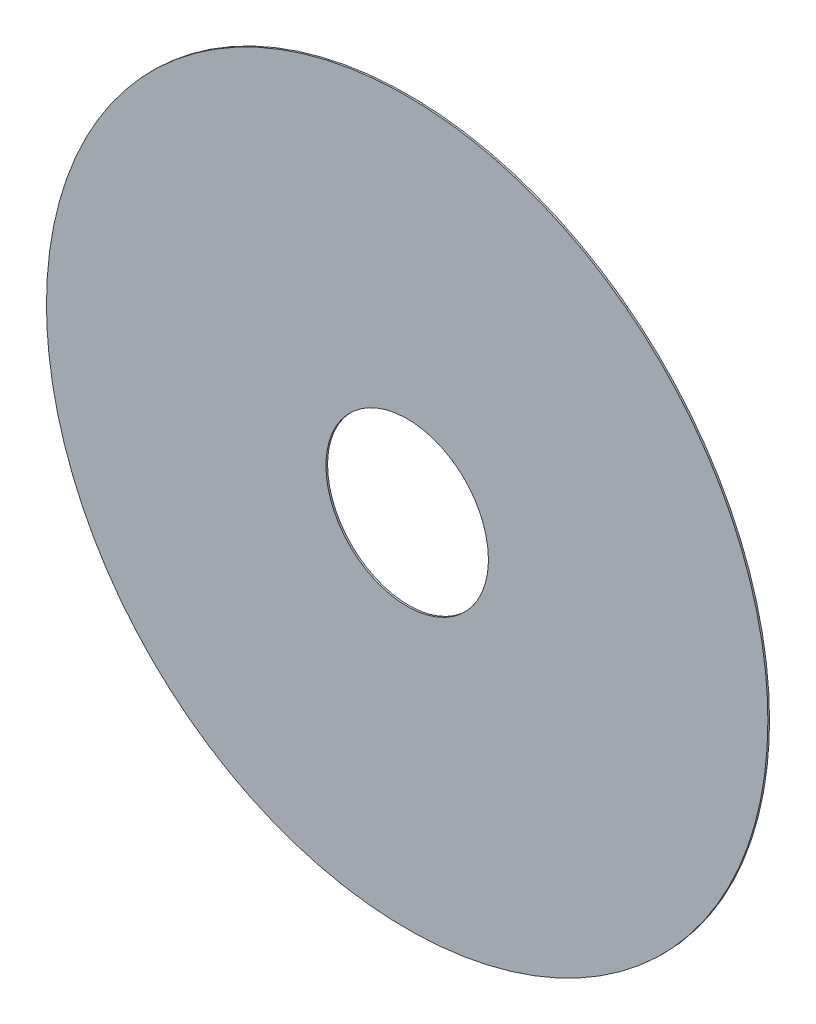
ISO-10303-21;
HEADER;
FILE_DESCRIPTION(('STEP AP214'),'2;1');
FILE_NAME('part.step','',(''),(''),'','','');
FILE_SCHEMA(('AUTOMOTIVE_DESIGN { 1 0 10303 214 1 1 1 1 }'));
ENDSEC;
DATA;
#1=APPLICATION_CONTEXT('core data for automotive mechanical design processes');
#2=APPLICATION_PROTOCOL_DEFINITION('international standard','automotive_design',2000,#1);
#3=PRODUCT_CONTEXT('',#1,'mechanical');
#4=PRODUCT('Part','Part','',(#3));
#5=PRODUCT_RELATED_PRODUCT_CATEGORY('part','',(#4));
#6=PRODUCT_DEFINITION_FORMATION('','',#4);
#7=PRODUCT_DEFINITION_CONTEXT('part definition',#1,'design');
#8=PRODUCT_DEFINITION('design','',#6,#7);
#9=PRODUCT_DEFINITION_SHAPE('','',#8);
#10=(LENGTH_UNIT() NAMED_UNIT(*) SI_UNIT(.MILLI.,.METRE.));
#11=(NAMED_UNIT(*) PLANE_ANGLE_UNIT() SI_UNIT($,.RADIAN.));
#12=(NAMED_UNIT(*) SI_UNIT($,.STERADIAN.) SOLID_ANGLE_UNIT());
#13=UNCERTAINTY_MEASURE_WITH_UNIT(LENGTH_MEASURE(1.E-05),#10,'distance_accuracy_value','');
#14=(GEOMETRIC_REPRESENTATION_CONTEXT(3) GLOBAL_UNCERTAINTY_ASSIGNED_CONTEXT((#13)) GLOBAL_UNIT_ASSIGNED_CONTEXT((#10,
#11,#12)) REPRESENTATION_CONTEXT('',''));
#15=CARTESIAN_POINT('',(0.,0.,0.));
#16=DIRECTION('',(0.,0.,1.));
#17=DIRECTION('',(1.,0.,0.));
#18=AXIS2_PLACEMENT_3D('',#15,#16,#17);
#19=CARTESIAN_POINT('',(0.,0.,0.));
#20=DIRECTION('',(0.,0.,1.));
#21=DIRECTION('',(1.,0.,0.));
#22=AXIS2_PLACEMENT_3D('',#19,#20,#21);
#23=CYLINDRICAL_SURFACE('',#22,22.1615);
#24=CARTESIAN_POINT('',(-22.1615,0.,0.1016));
#25=CARTESIAN_POINT('',(-22.1615021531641,0.263721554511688,0.1016));
#26=CARTESIAN_POINT('',(-22.156792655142,0.527442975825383,0.1016));
#27=CARTESIAN_POINT('',(-22.1379658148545,1.05454978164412,0.1016));
#28=CARTESIAN_POINT('',(-22.1238484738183,1.31793516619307,0.1016));
#29=CARTESIAN_POINT('',(-22.0862214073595,1.84403417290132,0.1016));
#30=CARTESIAN_POINT('',(-22.0627116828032,2.10674779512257,0.1016));
#31=CARTESIAN_POINT('',(-22.0063304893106,2.6311685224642,0.1016));
#32=CARTESIAN_POINT('',(-21.9734590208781,2.89287562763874,0.1016));
#33=CARTESIAN_POINT('',(-21.8983960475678,3.41494981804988,0.1016));
#34=CARTESIAN_POINT('',(-21.8562045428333,3.67531690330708,0.1016));
#35=CARTESIAN_POINT('',(-21.7625553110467,4.19437926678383,0.1016));
#36=CARTESIAN_POINT('',(-21.711097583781,4.45307454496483,0.1016));
#37=CARTESIAN_POINT('',(-21.5989814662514,4.96846363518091,0.1016));
#38=CARTESIAN_POINT('',(-21.5383230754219,5.22515744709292,0.1016));
#39=CARTESIAN_POINT('',(-21.4078829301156,5.73621649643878,0.1016));
#40=CARTESIAN_POINT('',(-21.3381011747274,5.99058173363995,0.1016));
#41=CARTESIAN_POINT('',(-21.1895032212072,6.49665948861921,0.1016));
#42=CARTESIAN_POINT('',(-21.1106870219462,6.74837200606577,0.1016));
#43=CARTESIAN_POINT('',(-20.9441206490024,7.24882345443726,0.1016));
#44=CARTESIAN_POINT('',(-20.8563704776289,7.49756238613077,0.1016));
#45=CARTESIAN_POINT('',(-20.6720480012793,7.99174965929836,0.1016));
#46=CARTESIAN_POINT('',(-20.575475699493,8.23719800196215,0.1016));
#47=CARTESIAN_POINT('',(-20.3736320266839,8.72449134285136,0.1016));
#48=CARTESIAN_POINT('',(-20.2683606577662,8.96633634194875,0.1016));
#49=CARTESIAN_POINT('',(-20.0492529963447,9.44611483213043,0.1016));
#50=CARTESIAN_POINT('',(-19.9354167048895,9.6840483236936,0.1016));
#51=CARTESIAN_POINT('',(-19.6993242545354,10.1557006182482,0.1016));
#52=CARTESIAN_POINT('',(-19.5770680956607,10.3894194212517,0.1016));
#53=CARTESIAN_POINT('',(-19.3242916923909,10.8523445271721,0.1016));
#54=CARTESIAN_POINT('',(-19.1937714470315,11.0815508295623,0.1016));
#55=CARTESIAN_POINT('',(-18.924633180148,11.5351588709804,0.1016));
#56=CARTESIAN_POINT('',(-18.7860151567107,11.7595606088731,0.1016));
#57=CARTESIAN_POINT('',(-18.5008579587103,12.2032735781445,0.1016));
#58=CARTESIAN_POINT('',(-18.3543187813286,12.4225848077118,0.1016));
#59=CARTESIAN_POINT('',(-18.0535060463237,12.8558372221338,0.1016));
#60=CARTESIAN_POINT('',(-17.8992324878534,13.0697784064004,0.1016));
#61=CARTESIAN_POINT('',(-17.5831477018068,13.492017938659,0.1016));
#62=CARTESIAN_POINT('',(-17.4213364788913,13.7003162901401,0.1016));
#63=CARTESIAN_POINT('',(-17.090382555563,14.1110047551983,0.1016));
#64=CARTESIAN_POINT('',(-16.9212398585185,14.31339487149,0.1016));
#65=CARTESIAN_POINT('',(-16.5758385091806,14.71200899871,0.1016));
#66=CARTESIAN_POINT('',(-16.399579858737,14.9082330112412,0.1016));
#67=CARTESIAN_POINT('',(-16.0401711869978,15.2942649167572,0.1016));
#68=CARTESIAN_POINT('',(-15.8570211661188,15.48407281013,0.1016));
#69=CARTESIAN_POINT('',(-15.4840631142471,15.8570306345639,0.1016));
#70=CARTESIAN_POINT('',(-15.2942550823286,16.0401805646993,0.1016));
#71=CARTESIAN_POINT('',(-14.9082228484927,16.3995890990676,0.1016));
#72=CARTESIAN_POINT('',(-14.7119986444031,16.5758477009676,0.1016));
#73=CARTESIAN_POINT('',(-14.3133840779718,16.9212489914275,0.1016));
#74=CARTESIAN_POINT('',(-14.1109937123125,17.0903916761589,0.1016));
#75=CARTESIAN_POINT('',(-13.7003047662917,17.4213455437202,0.1016));
#76=CARTESIAN_POINT('',(-13.4920061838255,17.5831567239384,0.1016));
#77=CARTESIAN_POINT('',(-13.0697664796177,17.8992411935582,0.1016));
#78=CARTESIAN_POINT('',(-12.8558253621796,18.0535144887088,0.1016));
#79=CARTESIAN_POINT('',(-12.4225732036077,18.3543266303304,0.1016));
#80=CARTESIAN_POINT('',(-12.2032621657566,18.5008654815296,0.1016));
#81=CARTESIAN_POINT('',(-11.7595495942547,18.7860220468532,0.1016));
#82=CARTESIAN_POINT('',(-11.5351480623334,18.9246397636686,0.1016));
#83=CARTESIAN_POINT('',(-11.0815404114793,19.1937774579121,0.1016));
#84=CARTESIAN_POINT('',(-10.8523342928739,19.324297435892,0.1016));
#85=CARTESIAN_POINT('',(-10.3894094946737,19.5770733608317,0.1016));
#86=CARTESIAN_POINT('',(-10.1556908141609,19.6993293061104,0.1016));
#87=CARTESIAN_POINT('',(-9.68403866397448,19.9354213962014,0.1016));
#88=CARTESIAN_POINT('',(-9.44610519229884,20.0492575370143,0.1016));
#89=CARTESIAN_POINT('',(-8.96632659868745,20.2683649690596,0.1016));
#90=CARTESIAN_POINT('',(-8.72448147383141,20.3736362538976,0.1016));
#91=CARTESIAN_POINT('',(-8.23718787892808,20.5754797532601,0.1016));
#92=CARTESIAN_POINT('',(-7.99173940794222,20.6720519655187,0.1016));
#93=CARTESIAN_POINT('',(-7.49755216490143,20.8563741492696,0.1016));
#94=CARTESIAN_POINT('',(-7.24881339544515,20.9441241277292,0.1016));
#95=CARTESIAN_POINT('',(-6.74836249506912,21.1106900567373,0.1016));
#96=CARTESIAN_POINT('',(-6.49665036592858,21.1895060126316,0.1016));
#97=CARTESIAN_POINT('',(-5.99057346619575,21.3381034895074,0.1016));
#98=CARTESIAN_POINT('',(-5.73620869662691,21.4078850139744,0.1016));
#99=CARTESIAN_POINT('',(-5.22515061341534,21.5383247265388,0.1016));
#100=CARTESIAN_POINT('',(-4.96845730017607,21.598982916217,0.1016));
#101=CARTESIAN_POINT('',(-4.45306919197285,21.7110986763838,0.1016));
#102=CARTESIAN_POINT('',(-4.19437439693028,21.7625562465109,0.1016));
#103=CARTESIAN_POINT('',(-3.67531293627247,21.8562052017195,0.1016));
#104=CARTESIAN_POINT('',(-3.41494627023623,21.8983965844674,0.1016));
#105=CARTESIAN_POINT('',(-2.89287280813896,21.9734593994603,0.1016));
#106=CARTESIAN_POINT('',(-2.63116601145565,22.0063308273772,0.1016));
#107=CARTESIAN_POINT('',(-2.1067457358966,22.0627118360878,0.1016));
#108=CARTESIAN_POINT('',(-1.84403225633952,22.0862214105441,0.1016));
#109=CARTESIAN_POINT('',(-1.31793341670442,22.1238487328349,0.1016));
#110=CARTESIAN_POINT('',(-1.05454805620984,22.1379664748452,0.1016));
#111=CARTESIAN_POINT('',(-0.527441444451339,22.1567921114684,0.1016));
#112=CARTESIAN_POINT('',(-0.26372019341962,22.1615000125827,0.1016));
#113=CARTESIAN_POINT('',(0.263722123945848,22.1614999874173,0.1016));
#114=CARTESIAN_POINT('',(0.527443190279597,22.1567920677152,0.1016));
#115=CARTESIAN_POINT('',(1.05454912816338,22.1379664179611,0.1016));
#116=CARTESIAN_POINT('',(1.31793399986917,22.1238486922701,0.1016));
#117=CARTESIAN_POINT('',(1.84403196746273,22.0862214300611,0.1016));
#118=CARTESIAN_POINT('',(2.10674506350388,22.0627118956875,0.1016));
#119=CARTESIAN_POINT('',(2.63116475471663,22.0063309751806,0.1016));
#120=CARTESIAN_POINT('',(2.89287134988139,21.9734595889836,0.1016));
#121=CARTESIAN_POINT('',(3.41494459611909,21.8983968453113,0.1016));
#122=CARTESIAN_POINT('',(3.67531124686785,21.8562054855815,0.1016));
#123=CARTESIAN_POINT('',(4.19437286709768,21.7625565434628,0.1016));
#124=CARTESIAN_POINT('',(4.45306783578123,21.7110989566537,0.1016));
#125=CARTESIAN_POINT('',(4.96845648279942,21.5989831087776,0.1016));
#126=CARTESIAN_POINT('',(5.22515015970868,21.5383248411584,0.1016));
#127=CARTESIAN_POINT('',(5.73620908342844,21.4078849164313,0.1016));
#128=CARTESIAN_POINT('',(5.99057432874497,21.3381032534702,0.1016));
#129=CARTESIAN_POINT('',(6.49665190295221,21.1895055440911,0.1016));
#130=CARTESIAN_POINT('',(6.74836423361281,21.1106895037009,0.1016));
#131=CARTESIAN_POINT('',(7.24881521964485,20.9441234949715,0.1016));
#132=CARTESIAN_POINT('',(7.49755387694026,20.856373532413,0.1016));
#133=CARTESIAN_POINT('',(7.99174060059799,20.6720514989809,0.1016));
#134=CARTESIAN_POINT('',(8.23718866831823,20.575479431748,0.1016));
#135=CARTESIAN_POINT('',(8.72448148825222,20.3736362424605,0.1016));
#136=CARTESIAN_POINT('',(8.96632624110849,20.268365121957,0.1016));
#137=CARTESIAN_POINT('',(9.44610429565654,20.0492579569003,0.1016));
#138=CARTESIAN_POINT('',(9.68403759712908,19.935421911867,0.1016));
#139=CARTESIAN_POINT('',(10.1556895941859,19.6993299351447,0.1016));
#140=CARTESIAN_POINT('',(10.3894082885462,19.5770740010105,0.1016));
#141=CARTESIAN_POINT('',(10.8523332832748,19.3242980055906,0.1016));
#142=CARTESIAN_POINT('',(11.0815395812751,19.193777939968,0.1016));
#143=CARTESIAN_POINT('',(11.5351477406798,18.9246399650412,0.1016));
#144=CARTESIAN_POINT('',(11.7595495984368,18.7860220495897,0.1016));
#145=CARTESIAN_POINT('',(12.2032627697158,18.5008650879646,0.1016));
#146=CARTESIAN_POINT('',(12.4225740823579,18.354326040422,0.1016));
#147=CARTESIAN_POINT('',(12.8558264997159,18.0535136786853,0.1016));
#148=CARTESIAN_POINT('',(13.0697676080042,17.8992403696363,0.1016));
#149=CARTESIAN_POINT('',(13.4920070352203,17.5831560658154,0.1016));
#150=CARTESIAN_POINT('',(13.7003053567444,17.4213450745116,0.1016));
#151=CARTESIAN_POINT('',(14.1109938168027,17.0903915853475,0.1016));
#152=CARTESIAN_POINT('',(14.3133839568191,16.9212490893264,0.1016));
#153=CARTESIAN_POINT('',(14.7119981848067,16.5758481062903,0.1016));
#154=CARTESIAN_POINT('',(14.9082222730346,16.3995896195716,0.1016));
#155=CARTESIAN_POINT('',(15.2942543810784,16.0401812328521,0.1016));
#156=CARTESIAN_POINT('',(15.4840623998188,15.8570313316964,0.1016));
#157=CARTESIAN_POINT('',(15.8570205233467,15.484073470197,0.1016));
#158=CARTESIAN_POINT('',(16.0401706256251,15.2942655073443,0.1016));
#159=CARTESIAN_POINT('',(16.399579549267,14.9082333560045,0.1016));
#160=CARTESIAN_POINT('',(16.5758383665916,14.7120091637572,0.1016));
#161=CARTESIAN_POINT('',(16.9212400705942,14.313394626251,0.1016));
#162=CARTESIAN_POINT('',(17.0903829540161,14.1110042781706,0.1016));
#163=CARTESIAN_POINT('',(17.4213370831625,13.7003155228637,0.1016));
#164=CARTESIAN_POINT('',(17.5831483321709,13.4920171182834,0.1016));
#165=CARTESIAN_POINT('',(17.8992330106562,13.0697776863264,0.1016));
#166=CARTESIAN_POINT('',(18.0535064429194,12.8558366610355,0.1016));
#167=CARTESIAN_POINT('',(18.3543189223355,12.4225845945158,0.1016));
#168=CARTESIAN_POINT('',(18.5008579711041,12.2032735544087,0.1016));
#169=CARTESIAN_POINT('',(18.7860149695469,11.7595609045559,0.1016));
#170=CARTESIAN_POINT('',(18.9246329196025,11.5351592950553,0.1016));
#171=CARTESIAN_POINT('',(19.193771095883,11.0815514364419,0.1016));
#172=CARTESIAN_POINT('',(19.3242913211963,10.8523451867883,0.1016));
#173=CARTESIAN_POINT('',(19.5770677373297,10.3894200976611,0.1016));
#174=CARTESIAN_POINT('',(19.6993239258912,10.1557012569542,0.1016));
#175=CARTESIAN_POINT('',(19.9354164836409,9.68404878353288,0.1016));
#176=CARTESIAN_POINT('',(20.0492528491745,9.446115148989,0.1016));
#177=CARTESIAN_POINT('',(20.2683606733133,8.96633631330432,0.1016));
#178=CARTESIAN_POINT('',(20.3736321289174,8.72449111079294,0.1016));
#179=CARTESIAN_POINT('',(20.5754759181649,8.23719745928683,0.1016));
#180=CARTESIAN_POINT('',(20.6720482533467,7.99174901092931,0.1016));
#181=CARTESIAN_POINT('',(20.8563707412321,7.49756165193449,0.1016));
#182=CARTESIAN_POINT('',(20.9441208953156,7.24882274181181,0.1016));
#183=CARTESIAN_POINT('',(21.1106872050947,6.74837142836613,0.1016));
#184=CARTESIAN_POINT('',(21.1895033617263,6.49665902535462,0.1016));
#185=CARTESIAN_POINT('',(21.3381012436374,5.99058148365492,0.1016));
#186=CARTESIAN_POINT('',(21.4078829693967,5.73621634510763,0.1016));
#187=CARTESIAN_POINT('',(21.5383230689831,5.22515746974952,0.1016));
#188=CARTESIAN_POINT('',(21.5989814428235,4.96846373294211,0.1016));
#189=CARTESIAN_POINT('',(21.711097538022,4.45307476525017,0.1016));
#190=CARTESIAN_POINT('',(21.7625552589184,4.19437953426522,0.1016));
#191=CARTESIAN_POINT('',(21.8562044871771,3.6753172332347,0.1016));
#192=CARTESIAN_POINT('',(21.8983959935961,3.41495016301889,0.1016));
#193=CARTESIAN_POINT('',(21.9734589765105,2.89287596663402,0.1016));
#194=CARTESIAN_POINT('',(22.0063304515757,2.63116884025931,0.1016));
#195=CARTESIAN_POINT('',(22.0627116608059,2.10674803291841,0.1016));
#196=CARTESIAN_POINT('',(22.0862213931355,1.8440343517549,0.1016));
#197=CARTESIAN_POINT('',(22.1238484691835,1.31793525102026,0.1016));
#198=CARTESIAN_POINT('',(22.1379658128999,1.05454983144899,0.1016));
#199=CARTESIAN_POINT('',(22.1567926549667,0.527442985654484,0.1016));
#200=CARTESIAN_POINT('',(22.1615021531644,0.2637215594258,0.1016));
#201=CARTESIAN_POINT('',(22.1615,0.,0.1016));
#202=B_SPLINE_CURVE_WITH_KNOTS('',3,(#24,#25,#26,#27,#28,#29,#30,#31,#32,#33,#34,#35,#36,#37,
#38,#39,#40,#41,#42,#43,#44,#45,#46,#47,#48,#49,#50,#51,#52,#53,#54,#55,#56,#57,#58,#59,#60,#61,
#62,#63,#64,#65,#66,#67,#68,#69,#70,#71,#72,#73,#74,#75,#76,#77,#78,#79,#80,#81,#82,#83,#84,#85,
#86,#87,#88,#89,#90,#91,#92,#93,#94,#95,#96,#97,#98,#99,#100,#101,#102,#103,#104,#105,#106,#107,
#108,#109,#110,#111,#112,#113,#114,#115,#116,#117,#118,#119,#120,#121,#122,#123,#124,#125,#126,
#127,#128,#129,#130,#131,#132,#133,#134,#135,#136,#137,#138,#139,#140,#141,#142,#143,#144,#145,
#146,#147,#148,#149,#150,#151,#152,#153,#154,#155,#156,#157,#158,#159,#160,#161,#162,#163,#164,
#165,#166,#167,#168,#169,#170,#171,#172,#173,#174,#175,#176,#177,#178,#179,#180,#181,#182,#183,
#184,#185,#186,#187,#188,#189,#190,#191,#192,#193,#194,#195,#196,#197,#198,#199,#200,#201),
.UNSPECIFIED.,.F.,.F.,(4,2,2,2,2,2,2,2,2,2,2,2,2,2,2,2,2,2,2,2,2,2,2,2,2,2,2,2,2,2,2,2,2,2,2,2,
2,2,2,2,2,2,2,2,2,2,2,2,2,2,2,2,2,2,2,2,2,2,2,2,2,2,2,2,2,2,2,2,2,2,2,2,2,2,2,2,2,2,2,2,2,2,2,2,
2,2,2,2,4),(0.,0.791122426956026,1.58224475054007,2.3733670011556,3.16448920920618,
3.95561140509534,4.7467336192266,5.53785588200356,6.3289782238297,7.12010066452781,
7.91122290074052,8.70234485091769,9.49346660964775,10.2845882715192,11.0757099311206,
11.8668316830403,12.6579536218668,13.4490758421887,14.2401981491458,15.0313199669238,
15.8224414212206,16.613562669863,17.4046838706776,18.1958051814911,18.9869267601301,
19.7780487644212,20.5691710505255,21.3602927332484,22.1514139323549,22.9425348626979,
23.7336557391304,24.5247767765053,25.3158981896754,26.1070201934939,26.8981424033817,
27.689263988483,28.4803851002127,29.2715059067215,30.0626265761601,30.8537472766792,
31.6448681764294,32.4359894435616,33.2271112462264,34.0182335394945,34.8093552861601,
35.6004764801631,36.391597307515,37.1827179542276,37.9738386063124,38.764959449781,
39.5560806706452,40.3472024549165,41.1383247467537,41.9294465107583,42.7205677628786,
43.5116886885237,44.3028094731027,45.0939303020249,45.8850513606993,46.6761728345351,
47.4672949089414,48.258417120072,49.0495388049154,49.8406601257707,50.6317812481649,
51.4229023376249,52.2140235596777,53.0051450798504,53.7962670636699,54.5873894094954,
55.3785114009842,56.1696331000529,56.9607546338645,57.751876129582,58.5429977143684,
59.3341195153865,60.1252416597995,60.9163640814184,61.7074863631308,62.4986085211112,
63.289730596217,64.0808526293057,64.8719746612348,65.6630967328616,66.4542188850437,
67.2453411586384,68.0364635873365,68.8275860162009,69.6187084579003),.UNSPECIFIED.);
#203=CARTESIAN_POINT('',(-22.1615,0.,0.1016));
#204=VERTEX_POINT('',#203);
#205=CARTESIAN_POINT('',(22.1615,0.,0.1016));
#206=VERTEX_POINT('',#205);
#207=EDGE_CURVE('E10',#204,#206,#202,.T.);
#208=ORIENTED_EDGE('',*,*,#207,.T.);
#209=CARTESIAN_POINT('',(22.1615,0.,0.));
#210=CARTESIAN_POINT('',(22.1615,0.,0.000846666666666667));
#211=CARTESIAN_POINT('',(22.1615,0.,0.00169333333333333));
#212=CARTESIAN_POINT('',(22.1615,0.,0.00338666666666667));
#213=CARTESIAN_POINT('',(22.1615,0.,0.00423333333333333));
#214=CARTESIAN_POINT('',(22.1615,0.,0.00592666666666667));
#215=CARTESIAN_POINT('',(22.1615,0.,0.00677333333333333));
#216=CARTESIAN_POINT('',(22.1615,0.,0.00846666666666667));
#217=CARTESIAN_POINT('',(22.1615,0.,0.00931333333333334));
#218=CARTESIAN_POINT('',(22.1615,0.,0.0110066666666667));
#219=CARTESIAN_POINT('',(22.1615,0.,0.0118533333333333));
#220=CARTESIAN_POINT('',(22.1615,0.,0.0135466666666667));
#221=CARTESIAN_POINT('',(22.1615,0.,0.0143933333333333));
#222=CARTESIAN_POINT('',(22.1615,0.,0.0160866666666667));
#223=CARTESIAN_POINT('',(22.1615,0.,0.0169333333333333));
#224=CARTESIAN_POINT('',(22.1615,0.,0.0186266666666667));
#225=CARTESIAN_POINT('',(22.1615,0.,0.0194733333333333));
#226=CARTESIAN_POINT('',(22.1615,0.,0.0211666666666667));
#227=CARTESIAN_POINT('',(22.1615,0.,0.0220133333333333));
#228=CARTESIAN_POINT('',(22.1615,0.,0.0237066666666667));
#229=CARTESIAN_POINT('',(22.1615,0.,0.0245533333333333));
#230=CARTESIAN_POINT('',(22.1615,0.,0.0262466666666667));
#231=CARTESIAN_POINT('',(22.1615,0.,0.0270933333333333));
#232=CARTESIAN_POINT('',(22.1615,0.,0.0287866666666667));
#233=CARTESIAN_POINT('',(22.1615,0.,0.0296333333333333));
#234=CARTESIAN_POINT('',(22.1615,0.,0.0313266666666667));
#235=CARTESIAN_POINT('',(22.1615,0.,0.0321733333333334));
#236=CARTESIAN_POINT('',(22.1615,0.,0.0338666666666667));
#237=CARTESIAN_POINT('',(22.1615,0.,0.0347133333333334));
#238=CARTESIAN_POINT('',(22.1615,0.,0.0364066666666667));
#239=CARTESIAN_POINT('',(22.1615,0.,0.0372533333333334));
#240=CARTESIAN_POINT('',(22.1615,0.,0.0389466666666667));
#241=CARTESIAN_POINT('',(22.1615,0.,0.0397933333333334));
#242=CARTESIAN_POINT('',(22.1615,0.,0.0414866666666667));
#243=CARTESIAN_POINT('',(22.1615,0.,0.0423333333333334));
#244=CARTESIAN_POINT('',(22.1615,0.,0.0440266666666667));
#245=CARTESIAN_POINT('',(22.1615,0.,0.0448733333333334));
#246=CARTESIAN_POINT('',(22.1615,0.,0.0465666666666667));
#247=CARTESIAN_POINT('',(22.1615,0.,0.0474133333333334));
#248=CARTESIAN_POINT('',(22.1615,0.,0.0491066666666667));
#249=CARTESIAN_POINT('',(22.1615,0.,0.0499533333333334));
#250=CARTESIAN_POINT('',(22.1615,0.,0.0516466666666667));
#251=CARTESIAN_POINT('',(22.1615,0.,0.0524933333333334));
#252=CARTESIAN_POINT('',(22.1615,0.,0.0541866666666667));
#253=CARTESIAN_POINT('',(22.1615,0.,0.0550333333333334));
#254=CARTESIAN_POINT('',(22.1615,0.,0.0567266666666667));
#255=CARTESIAN_POINT('',(22.1615,0.,0.0575733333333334));
#256=CARTESIAN_POINT('',(22.1615,0.,0.0592666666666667));
#257=CARTESIAN_POINT('',(22.1615,0.,0.0601133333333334));
#258=CARTESIAN_POINT('',(22.1615,0.,0.0618066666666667));
#259=CARTESIAN_POINT('',(22.1615,0.,0.0626533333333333));
#260=CARTESIAN_POINT('',(22.1615,0.,0.0643466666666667));
#261=CARTESIAN_POINT('',(22.1615,0.,0.0651933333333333));
#262=CARTESIAN_POINT('',(22.1615,0.,0.0668866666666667));
#263=CARTESIAN_POINT('',(22.1615,0.,0.0677333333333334));
#264=CARTESIAN_POINT('',(22.1615,0.,0.0694266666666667));
#265=CARTESIAN_POINT('',(22.1615,0.,0.0702733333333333));
#266=CARTESIAN_POINT('',(22.1615,0.,0.0719666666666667));
#267=CARTESIAN_POINT('',(22.1615,0.,0.0728133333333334));
#268=CARTESIAN_POINT('',(22.1615,0.,0.0745066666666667));
#269=CARTESIAN_POINT('',(22.1615,0.,0.0753533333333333));
#270=CARTESIAN_POINT('',(22.1615,0.,0.0770466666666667));
#271=CARTESIAN_POINT('',(22.1615,0.,0.0778933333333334));
#272=CARTESIAN_POINT('',(22.1615,0.,0.0795866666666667));
#273=CARTESIAN_POINT('',(22.1615,0.,0.0804333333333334));
#274=CARTESIAN_POINT('',(22.1615,0.,0.0821266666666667));
#275=CARTESIAN_POINT('',(22.1615,0.,0.0829733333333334));
#276=CARTESIAN_POINT('',(22.1615,0.,0.0846666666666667));
#277=CARTESIAN_POINT('',(22.1615,0.,0.0855133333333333));
#278=CARTESIAN_POINT('',(22.1615,0.,0.0872066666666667));
#279=CARTESIAN_POINT('',(22.1615,0.,0.0880533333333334));
#280=CARTESIAN_POINT('',(22.1615,0.,0.0897466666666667));
#281=CARTESIAN_POINT('',(22.1615,0.,0.0905933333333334));
#282=CARTESIAN_POINT('',(22.1615,0.,0.0922866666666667));
#283=CARTESIAN_POINT('',(22.1615,0.,0.0931333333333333));
#284=CARTESIAN_POINT('',(22.1615,0.,0.0948266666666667));
#285=CARTESIAN_POINT('',(22.1615,0.,0.0956733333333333));
#286=CARTESIAN_POINT('',(22.1615,0.,0.0973666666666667));
#287=CARTESIAN_POINT('',(22.1615,0.,0.0982133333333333));
#288=CARTESIAN_POINT('',(22.1615,0.,0.0999066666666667));
#289=CARTESIAN_POINT('',(22.1615,0.,0.100753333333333));
#290=CARTESIAN_POINT('',(22.1615,0.,0.1016));
#291=B_SPLINE_CURVE_WITH_KNOTS('',3,(#209,#210,#211,#212,#213,#214,#215,#216,#217,#218,#219,
#220,#221,#222,#223,#224,#225,#226,#227,#228,#229,#230,#231,#232,#233,#234,#235,#236,#237,#238,
#239,#240,#241,#242,#243,#244,#245,#246,#247,#248,#249,#250,#251,#252,#253,#254,#255,#256,#257,
#258,#259,#260,#261,#262,#263,#264,#265,#266,#267,#268,#269,#270,#271,#272,#273,#274,#275,#276,
#277,#278,#279,#280,#281,#282,#283,#284,#285,#286,#287,#288,#289,#290),.UNSPECIFIED.,.F.,.F.,(4,
2,2,2,2,2,2,2,2,2,2,2,2,2,2,2,2,2,2,2,2,2,2,2,2,2,2,2,2,2,2,2,2,2,2,2,2,2,2,2,4),(0.,0.00254,
0.00508,0.00762,0.01016,0.0127,0.01524,0.01778,0.02032,0.02286,0.0254,0.02794,0.03048,0.03302,
0.03556,0.0381,0.04064,0.04318,0.04572,0.04826,0.0508,0.05334,0.05588,0.05842,0.06096,0.0635,
0.06604,0.06858,0.07112,0.07366,0.0762,0.07874,0.08128,0.08382,0.08636,0.0889,0.09144,0.09398,
0.09652,0.09906,0.1016),.UNSPECIFIED.);
#292=CARTESIAN_POINT('',(22.1615,0.,0.));
#293=VERTEX_POINT('',#292);
#294=EDGE_CURVE('E33',#293,#206,#291,.T.);
#295=ORIENTED_EDGE('',*,*,#294,.F.);
#296=CARTESIAN_POINT('',(22.1615,0.,0.));
#297=CARTESIAN_POINT('',(22.1615021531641,0.263721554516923,0.));
#298=CARTESIAN_POINT('',(22.1567926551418,0.527442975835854,0.));
#299=CARTESIAN_POINT('',(22.1379658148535,1.05454978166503,0.));
#300=CARTESIAN_POINT('',(22.1238484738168,1.31793516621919,0.));
#301=CARTESIAN_POINT('',(22.0862214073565,1.8440341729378,0.));
#302=CARTESIAN_POINT('',(22.0627116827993,2.10674779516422,0.));
#303=CARTESIAN_POINT('',(22.0063304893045,2.63116852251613,0.));
#304=CARTESIAN_POINT('',(21.9734590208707,2.89287562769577,0.));
#305=CARTESIAN_POINT('',(21.8983960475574,3.41494981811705,0.));
#306=CARTESIAN_POINT('',(21.8562045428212,3.67531690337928,0.));
#307=CARTESIAN_POINT('',(21.762555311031,4.19437926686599,0.));
#308=CARTESIAN_POINT('',(21.7110975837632,4.45307454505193,0.));
#309=CARTESIAN_POINT('',(21.5989814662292,4.96846363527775,0.));
#310=CARTESIAN_POINT('',(21.5383230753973,5.22515744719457,0.));
#311=CARTESIAN_POINT('',(21.4078829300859,5.73621649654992,0.));
#312=CARTESIAN_POINT('',(21.3381011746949,5.99058173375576,0.));
#313=CARTESIAN_POINT('',(21.1895032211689,6.49665948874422,0.));
#314=CARTESIAN_POINT('',(21.1106870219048,6.7483720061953,0.));
#315=CARTESIAN_POINT('',(20.9441206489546,7.24882345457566,0.));
#316=CARTESIAN_POINT('',(20.8563704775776,7.49756238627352,0.));
#317=CARTESIAN_POINT('',(20.6720480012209,7.99174965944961,0.));
#318=CARTESIAN_POINT('',(20.5754756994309,8.23719800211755,0.));
#319=CARTESIAN_POINT('',(20.3736320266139,8.72449134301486,0.));
#320=CARTESIAN_POINT('',(20.2683606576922,8.9663363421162,0.));
#321=CARTESIAN_POINT('',(20.0492529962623,9.44611483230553,0.));
#322=CARTESIAN_POINT('',(19.9354167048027,9.68404832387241,0.));
#323=CARTESIAN_POINT('',(19.6993242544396,10.1557006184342,0.));
#324=CARTESIAN_POINT('',(19.5770680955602,10.3894194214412,0.));
#325=CARTESIAN_POINT('',(19.3242916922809,10.8523445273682,0.));
#326=CARTESIAN_POINT('',(19.1937714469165,11.0815508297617,0.));
#327=CARTESIAN_POINT('',(18.9246331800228,11.5351588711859,0.));
#328=CARTESIAN_POINT('',(18.7860151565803,11.7595606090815,0.));
#329=CARTESIAN_POINT('',(18.5008579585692,12.2032735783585,0.));
#330=CARTESIAN_POINT('',(18.3543187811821,12.4225848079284,0.));
#331=CARTESIAN_POINT('',(18.053506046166,12.8558372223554,0.));
#332=CARTESIAN_POINT('',(17.89923248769,13.0697784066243,0.));
#333=CARTESIAN_POINT('',(17.5831477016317,13.4920179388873,0.));
#334=CARTESIAN_POINT('',(17.4213364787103,13.7003162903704,0.));
#335=CARTESIAN_POINT('',(17.0903825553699,14.1110047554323,0.));
#336=CARTESIAN_POINT('',(16.9212398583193,14.3133948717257,0.));
#337=CARTESIAN_POINT('',(16.5758385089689,14.7120089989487,0.));
#338=CARTESIAN_POINT('',(16.3995798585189,14.9082330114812,0.));
#339=CARTESIAN_POINT('',(16.0401711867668,15.2942649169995,0.));
#340=CARTESIAN_POINT('',(15.8570211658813,15.4840728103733,0.));
#341=CARTESIAN_POINT('',(15.4840631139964,15.8570306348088,0.));
#342=CARTESIAN_POINT('',(15.2942550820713,16.0401805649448,0.));
#343=CARTESIAN_POINT('',(14.9082228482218,16.3995890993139,0.));
#344=CARTESIAN_POINT('',(14.7119986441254,16.5758477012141,0.));
#345=CARTESIAN_POINT('',(14.3133840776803,16.9212489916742,0.));
#346=CARTESIAN_POINT('',(14.1109937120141,17.0903916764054,0.));
#347=CARTESIAN_POINT('',(13.7003047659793,17.4213455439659,0.));
#348=CARTESIAN_POINT('',(13.4920061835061,17.5831567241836,0.));
#349=CARTESIAN_POINT('',(13.069766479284,17.8992411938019,0.));
#350=CARTESIAN_POINT('',(12.8558253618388,18.0535144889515,0.));
#351=CARTESIAN_POINT('',(12.4225732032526,18.3543266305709,0.));
#352=CARTESIAN_POINT('',(12.2032621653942,18.5008654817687,0.));
#353=CARTESIAN_POINT('',(11.7595495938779,18.7860220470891,0.));
#354=CARTESIAN_POINT('',(11.5351480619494,18.9246397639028,0.));
#355=CARTESIAN_POINT('',(11.0815404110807,19.1937774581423,0.));
#356=CARTESIAN_POINT('',(10.852334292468,19.32429743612,0.));
#357=CARTESIAN_POINT('',(10.3894094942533,19.5770733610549,0.));
#358=CARTESIAN_POINT('',(10.1556908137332,19.6993293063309,0.));
#359=CARTESIAN_POINT('',(9.68403866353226,19.9354213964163,0.));
#360=CARTESIAN_POINT('',(9.44610519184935,20.0492575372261,0.));
#361=CARTESIAN_POINT('',(8.96632659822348,20.268364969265,0.));
#362=CARTESIAN_POINT('',(8.72448147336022,20.3736362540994,0.));
#363=CARTESIAN_POINT('',(8.23718787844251,20.5754797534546,0.));
#364=CARTESIAN_POINT('',(7.9917394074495,20.6720519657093,0.));
#365=CARTESIAN_POINT('',(7.49755216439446,20.8563741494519,0.));
#366=CARTESIAN_POINT('',(7.2488133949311,20.9441241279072,0.));
#367=CARTESIAN_POINT('',(6.74836249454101,21.1106900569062,0.));
#368=CARTESIAN_POINT('',(6.4966503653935,21.1895060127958,0.));
#369=CARTESIAN_POINT('',(5.99057346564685,21.3381034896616,0.));
#370=CARTESIAN_POINT('',(5.73620869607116,21.4078850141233,0.));
#371=CARTESIAN_POINT('',(5.22515061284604,21.538324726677,0.));
#372=CARTESIAN_POINT('',(4.96845729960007,21.5989829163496,0.));
#373=CARTESIAN_POINT('',(4.45306919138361,21.7110986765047,0.));
#374=CARTESIAN_POINT('',(4.1943743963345,21.7625562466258,0.));
#375=CARTESIAN_POINT('',(3.67531293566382,21.8562052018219,0.));
#376=CARTESIAN_POINT('',(3.41494626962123,21.8983965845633,0.));
#377=CARTESIAN_POINT('',(2.89287280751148,21.9734593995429,0.));
#378=CARTESIAN_POINT('',(2.63116601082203,22.006330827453,0.));
#379=CARTESIAN_POINT('',(2.10674573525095,22.0627118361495,0.));
#380=CARTESIAN_POINT('',(1.84403225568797,22.0862214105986,0.));
#381=CARTESIAN_POINT('',(1.31793341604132,22.1238487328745,0.));
#382=CARTESIAN_POINT('',(1.05454805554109,22.1379664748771,0.));
#383=CARTESIAN_POINT('',(0.527441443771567,22.1567921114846,0.));
#384=CARTESIAN_POINT('',(0.263720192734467,22.1615000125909,0.));
#385=CARTESIAN_POINT('',(-0.263722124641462,22.161499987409,0.));
#386=CARTESIAN_POINT('',(-0.527443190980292,22.1567920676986,0.));
#387=CARTESIAN_POINT('',(-1.05454912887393,22.1379664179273,0.));
#388=CARTESIAN_POINT('',(-1.31793400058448,22.1238486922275,0.));
#389=CARTESIAN_POINT('',(-1.84403196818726,22.0862214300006,0.));
#390=CARTESIAN_POINT('',(-2.10674506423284,22.062711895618,0.));
#391=CARTESIAN_POINT('',(-2.63116475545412,22.0063309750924,0.));
#392=CARTESIAN_POINT('',(-2.89287135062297,21.973459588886,0.));
#393=CARTESIAN_POINT('',(-3.41494459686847,21.8983968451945,0.));
#394=CARTESIAN_POINT('',(-3.67531124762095,21.8562054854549,0.));
#395=CARTESIAN_POINT('',(-4.19437286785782,21.7625565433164,0.));
#396=CARTESIAN_POINT('',(-4.4530678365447,21.7110989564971,0.));
#397=CARTESIAN_POINT('',(-4.96845648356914,21.5989831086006,0.));
#398=CARTESIAN_POINT('',(-5.22515016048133,21.538324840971,0.));
#399=CARTESIAN_POINT('',(-5.73620908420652,21.4078849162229,0.));
#400=CARTESIAN_POINT('',(-5.99057432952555,21.3381032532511,0.));
#401=CARTESIAN_POINT('',(-6.49665190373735,21.1895055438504,0.));
#402=CARTESIAN_POINT('',(-6.74836423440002,21.1106895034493,0.));
#403=CARTESIAN_POINT('',(-7.24881522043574,20.9441234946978,0.));
#404=CARTESIAN_POINT('',(-7.49755387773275,20.8563735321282,0.));
#405=CARTESIAN_POINT('',(-7.99174060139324,20.6720514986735,0.));
#406=CARTESIAN_POINT('',(-8.23718866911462,20.5754794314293,0.));
#407=CARTESIAN_POINT('',(-8.72448148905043,20.3736362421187,0.));
#408=CARTESIAN_POINT('',(-8.96632624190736,20.2683651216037,0.));
#409=CARTESIAN_POINT('',(-9.44610429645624,20.0492579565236,0.));
#410=CARTESIAN_POINT('',(-9.68403759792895,19.9354219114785,0.));
#411=CARTESIAN_POINT('',(-10.1556895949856,19.6993299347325,0.));
#412=CARTESIAN_POINT('',(-10.3894082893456,19.5770740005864,0.));
#413=CARTESIAN_POINT('',(-10.852333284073,19.3242980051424,0.));
#414=CARTESIAN_POINT('',(-11.0815395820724,19.1937779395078,0.));
#415=CARTESIAN_POINT('',(-11.5351477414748,18.9246399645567,0.));
#416=CARTESIAN_POINT('',(-11.7595495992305,18.786022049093,0.));
#417=CARTESIAN_POINT('',(-12.2032627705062,18.5008650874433,0.));
#418=CARTESIAN_POINT('',(-12.4225740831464,18.3543260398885,0.));
#419=CARTESIAN_POINT('',(-12.8558265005,18.053513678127,0.));
#420=CARTESIAN_POINT('',(-13.0697676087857,17.8992403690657,0.));
#421=CARTESIAN_POINT('',(-13.4920070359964,17.58315606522,0.));
#422=CARTESIAN_POINT('',(-13.7003053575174,17.4213450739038,0.));
#423=CARTESIAN_POINT('',(-14.1109938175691,17.0903915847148,0.));
#424=CARTESIAN_POINT('',(-14.3133839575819,16.9212490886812,0.));
#425=CARTESIAN_POINT('',(-14.7119981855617,16.5758481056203,0.));
#426=CARTESIAN_POINT('',(-14.9082222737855,16.399589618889,0.));
#427=CARTESIAN_POINT('',(-15.2942543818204,16.0401812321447,0.));
#428=CARTESIAN_POINT('',(-15.4840624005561,15.8570313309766,0.));
#429=CARTESIAN_POINT('',(-15.8570205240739,15.4840734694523,0.));
#430=CARTESIAN_POINT('',(-16.0401706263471,15.2942655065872,0.));
#431=CARTESIAN_POINT('',(-16.3995795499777,14.9082333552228,0.));
#432=CARTESIAN_POINT('',(-16.5758383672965,14.7120091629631,0.));
#433=CARTESIAN_POINT('',(-16.9212400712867,14.3133946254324,0.));
#434=CARTESIAN_POINT('',(-17.0903829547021,14.1110042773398,0.));
#435=CARTESIAN_POINT('',(-17.4213370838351,13.7003155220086,0.));
#436=CARTESIAN_POINT('',(-17.5831483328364,13.4920171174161,0.));
#437=CARTESIAN_POINT('',(-17.8992330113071,13.0697776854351,0.));
#438=CARTESIAN_POINT('',(-18.0535064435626,12.8558366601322,0.));
#439=CARTESIAN_POINT('',(-18.354318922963,12.4225845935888,0.));
#440=CARTESIAN_POINT('',(-18.5008579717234,12.20327355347,0.));
#441=CARTESIAN_POINT('',(-18.7860149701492,11.7595609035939,0.));
#442=CARTESIAN_POINT('',(-18.924632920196,11.5351592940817,0.));
#443=CARTESIAN_POINT('',(-19.1937710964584,11.0815514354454,0.));
#444=CARTESIAN_POINT('',(-19.3242913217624,10.8523451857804,0.));
#445=CARTESIAN_POINT('',(-19.5770677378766,10.3894200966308,0.));
#446=CARTESIAN_POINT('',(-19.6993239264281,10.1557012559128,0.));
#447=CARTESIAN_POINT('',(-19.9354164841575,9.68404878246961,0.));
#448=CARTESIAN_POINT('',(-20.0492528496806,9.44611514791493,0.));
#449=CARTESIAN_POINT('',(-20.268360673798,8.96633631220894,0.));
#450=CARTESIAN_POINT('',(-20.3736321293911,8.72449110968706,0.));
#451=CARTESIAN_POINT('',(-20.575475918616,8.23719745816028,0.));
#452=CARTESIAN_POINT('',(-20.6720482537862,7.9917490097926,0.));
#453=CARTESIAN_POINT('',(-20.856370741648,7.49756165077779,0.));
#454=CARTESIAN_POINT('',(-20.9441208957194,7.2488227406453,0.));
#455=CARTESIAN_POINT('',(-21.1106872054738,6.74837142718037,0.));
#456=CARTESIAN_POINT('',(-21.1895033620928,6.49665902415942,0.));
#457=CARTESIAN_POINT('',(-21.3381012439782,5.99058148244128,0.));
#458=CARTESIAN_POINT('',(-21.4078829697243,5.73621634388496,0.));
#459=CARTESIAN_POINT('',(-21.538323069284,5.22515746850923,0.));
#460=CARTESIAN_POINT('',(-21.5989814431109,4.96846373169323,0.));
#461=CARTESIAN_POINT('',(-21.7110975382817,4.45307476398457,0.));
#462=CARTESIAN_POINT('',(-21.7625552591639,4.19437953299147,0.));
#463=CARTESIAN_POINT('',(-21.8562044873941,3.67531723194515,0.));
#464=CARTESIAN_POINT('',(-21.8983959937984,3.41495016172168,0.));
#465=CARTESIAN_POINT('',(-21.9734589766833,2.892875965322,0.));
#466=CARTESIAN_POINT('',(-22.0063304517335,2.63116883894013,0.));
#467=CARTESIAN_POINT('',(-22.062711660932,2.10674803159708,0.));
#468=CARTESIAN_POINT('',(-22.0862213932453,1.84403435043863,0.));
#469=CARTESIAN_POINT('',(-22.1238484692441,1.31793524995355,0.));
#470=CARTESIAN_POINT('',(-22.1379658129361,1.0545498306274,0.));
#471=CARTESIAN_POINT('',(-22.1567926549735,0.527442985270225,0.));
#472=CARTESIAN_POINT('',(-22.1615021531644,0.263721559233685,0.));
#473=CARTESIAN_POINT('',(-22.1615,0.,0.));
#474=B_SPLINE_CURVE_WITH_KNOTS('',3,(#296,#297,#298,#299,#300,#301,#302,#303,#304,#305,#306,
#307,#308,#309,#310,#311,#312,#313,#314,#315,#316,#317,#318,#319,#320,#321,#322,#323,#324,#325,
#326,#327,#328,#329,#330,#331,#332,#333,#334,#335,#336,#337,#338,#339,#340,#341,#342,#343,#344,
#345,#346,#347,#348,#349,#350,#351,#352,#353,#354,#355,#356,#357,#358,#359,#360,#361,#362,#363,
#364,#365,#366,#367,#368,#369,#370,#371,#372,#373,#374,#375,#376,#377,#378,#379,#380,#381,#382,
#383,#384,#385,#386,#387,#388,#389,#390,#391,#392,#393,#394,#395,#396,#397,#398,#399,#400,#401,
#402,#403,#404,#405,#406,#407,#408,#409,#410,#411,#412,#413,#414,#415,#416,#417,#418,#419,#420,
#421,#422,#423,#424,#425,#426,#427,#428,#429,#430,#431,#432,#433,#434,#435,#436,#437,#438,#439,
#440,#441,#442,#443,#444,#445,#446,#447,#448,#449,#450,#451,#452,#453,#454,#455,#456,#457,#458,
#459,#460,#461,#462,#463,#464,#465,#466,#467,#468,#469,#470,#471,#472,#473),.UNSPECIFIED.,.F.,
.F.,(4,2,2,2,2,2,2,2,2,2,2,2,2,2,2,2,2,2,2,2,2,2,2,2,2,2,2,2,2,2,2,2,2,2,2,2,2,2,2,2,2,2,2,2,2,
2,2,2,2,2,2,2,2,2,2,2,2,2,2,2,2,2,2,2,2,2,2,2,2,2,2,2,2,2,2,2,2,2,2,2,2,2,2,2,2,2,2,2,4),(0.,
0.791122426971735,1.58224475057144,2.37336700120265,3.16448920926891,3.95561140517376,
4.74673361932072,5.53785588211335,6.32897822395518,7.12010066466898,7.91122290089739,
8.70234485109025,9.49346660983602,10.2845882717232,11.0757099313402,11.8668316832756,
12.6579536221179,13.4490758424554,14.2401981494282,15.0313199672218,15.8224414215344,
16.6135626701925,17.4046838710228,18.1958051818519,18.9869267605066,19.7780487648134,
20.5691710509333,21.360292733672,22.1514139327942,22.9425348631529,23.733655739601,
24.5247767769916,25.3158981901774,26.1070201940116,26.8981424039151,27.6892639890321,
28.4803851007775,29.271505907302,30.0626265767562,30.853747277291,31.6448681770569,
32.4359894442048,33.2271112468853,34.0182335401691,34.8093552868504,35.6004764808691,
36.3915973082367,37.1827179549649,37.9738386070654,38.7649594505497,39.5560806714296,
40.3472024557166,41.1383247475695,41.9294465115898,42.7205677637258,43.5116886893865,
44.3028094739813,45.0939303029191,45.8850513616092,46.6761728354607,47.4672949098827,
48.258417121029,49.0495388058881,49.8406601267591,50.6317812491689,51.4229023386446,
52.2140235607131,53.0051450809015,53.7962670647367,54.5873894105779,55.3785114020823,
56.1696331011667,56.9607546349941,57.7518761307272,58.5429977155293,59.3341195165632,
60.1252416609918,60.9163640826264,61.7074863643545,62.4986085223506,63.2897305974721,
64.0808526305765,64.8719746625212,65.6630967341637,66.4542188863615,67.2453411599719,
68.0364635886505,68.8275860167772,69.6187084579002),.UNSPECIFIED.);
#475=CARTESIAN_POINT('',(-22.1615,0.,0.));
#476=VERTEX_POINT('',#475);
#477=EDGE_CURVE('E23',#293,#476,#474,.T.);
#478=ORIENTED_EDGE('',*,*,#477,.T.);
#479=CARTESIAN_POINT('',(-22.1615,0.,0.));
#480=CARTESIAN_POINT('',(-22.1615,0.,0.000846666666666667));
#481=CARTESIAN_POINT('',(-22.1615,0.,0.00169333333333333));
#482=CARTESIAN_POINT('',(-22.1615,0.,0.00338666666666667));
#483=CARTESIAN_POINT('',(-22.1615,0.,0.00423333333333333));
#484=CARTESIAN_POINT('',(-22.1615,0.,0.00592666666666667));
#485=CARTESIAN_POINT('',(-22.1615,0.,0.00677333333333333));
#486=CARTESIAN_POINT('',(-22.1615,0.,0.00846666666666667));
#487=CARTESIAN_POINT('',(-22.1615,0.,0.00931333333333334));
#488=CARTESIAN_POINT('',(-22.1615,0.,0.0110066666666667));
#489=CARTESIAN_POINT('',(-22.1615,0.,0.0118533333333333));
#490=CARTESIAN_POINT('',(-22.1615,0.,0.0135466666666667));
#491=CARTESIAN_POINT('',(-22.1615,0.,0.0143933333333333));
#492=CARTESIAN_POINT('',(-22.1615,0.,0.0160866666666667));
#493=CARTESIAN_POINT('',(-22.1615,0.,0.0169333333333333));
#494=CARTESIAN_POINT('',(-22.1615,0.,0.0186266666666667));
#495=CARTESIAN_POINT('',(-22.1615,0.,0.0194733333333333));
#496=CARTESIAN_POINT('',(-22.1615,0.,0.0211666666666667));
#497=CARTESIAN_POINT('',(-22.1615,0.,0.0220133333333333));
#498=CARTESIAN_POINT('',(-22.1615,0.,0.0237066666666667));
#499=CARTESIAN_POINT('',(-22.1615,0.,0.0245533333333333));
#500=CARTESIAN_POINT('',(-22.1615,0.,0.0262466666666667));
#501=CARTESIAN_POINT('',(-22.1615,0.,0.0270933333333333));
#502=CARTESIAN_POINT('',(-22.1615,0.,0.0287866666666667));
#503=CARTESIAN_POINT('',(-22.1615,0.,0.0296333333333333));
#504=CARTESIAN_POINT('',(-22.1615,0.,0.0313266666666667));
#505=CARTESIAN_POINT('',(-22.1615,0.,0.0321733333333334));
#506=CARTESIAN_POINT('',(-22.1615,0.,0.0338666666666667));
#507=CARTESIAN_POINT('',(-22.1615,0.,0.0347133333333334));
#508=CARTESIAN_POINT('',(-22.1615,0.,0.0364066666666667));
#509=CARTESIAN_POINT('',(-22.1615,0.,0.0372533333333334));
#510=CARTESIAN_POINT('',(-22.1615,0.,0.0389466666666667));
#511=CARTESIAN_POINT('',(-22.1615,0.,0.0397933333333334));
#512=CARTESIAN_POINT('',(-22.1615,0.,0.0414866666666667));
#513=CARTESIAN_POINT('',(-22.1615,0.,0.0423333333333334));
#514=CARTESIAN_POINT('',(-22.1615,0.,0.0440266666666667));
#515=CARTESIAN_POINT('',(-22.1615,0.,0.0448733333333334));
#516=CARTESIAN_POINT('',(-22.1615,0.,0.0465666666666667));
#517=CARTESIAN_POINT('',(-22.1615,0.,0.0474133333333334));
#518=CARTESIAN_POINT('',(-22.1615,0.,0.0491066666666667));
#519=CARTESIAN_POINT('',(-22.1615,0.,0.0499533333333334));
#520=CARTESIAN_POINT('',(-22.1615,0.,0.0516466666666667));
#521=CARTESIAN_POINT('',(-22.1615,0.,0.0524933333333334));
#522=CARTESIAN_POINT('',(-22.1615,0.,0.0541866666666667));
#523=CARTESIAN_POINT('',(-22.1615,0.,0.0550333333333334));
#524=CARTESIAN_POINT('',(-22.1615,0.,0.0567266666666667));
#525=CARTESIAN_POINT('',(-22.1615,0.,0.0575733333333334));
#526=CARTESIAN_POINT('',(-22.1615,0.,0.0592666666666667));
#527=CARTESIAN_POINT('',(-22.1615,0.,0.0601133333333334));
#528=CARTESIAN_POINT('',(-22.1615,0.,0.0618066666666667));
#529=CARTESIAN_POINT('',(-22.1615,0.,0.0626533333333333));
#530=CARTESIAN_POINT('',(-22.1615,0.,0.0643466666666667));
#531=CARTESIAN_POINT('',(-22.1615,0.,0.0651933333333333));
#532=CARTESIAN_POINT('',(-22.1615,0.,0.0668866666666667));
#533=CARTESIAN_POINT('',(-22.1615,0.,0.0677333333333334));
#534=CARTESIAN_POINT('',(-22.1615,0.,0.0694266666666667));
#535=CARTESIAN_POINT('',(-22.1615,0.,0.0702733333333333));
#536=CARTESIAN_POINT('',(-22.1615,0.,0.0719666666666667));
#537=CARTESIAN_POINT('',(-22.1615,0.,0.0728133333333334));
#538=CARTESIAN_POINT('',(-22.1615,0.,0.0745066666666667));
#539=CARTESIAN_POINT('',(-22.1615,0.,0.0753533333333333));
#540=CARTESIAN_POINT('',(-22.1615,0.,0.0770466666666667));
#541=CARTESIAN_POINT('',(-22.1615,0.,0.0778933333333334));
#542=CARTESIAN_POINT('',(-22.1615,0.,0.0795866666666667));
#543=CARTESIAN_POINT('',(-22.1615,0.,0.0804333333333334));
#544=CARTESIAN_POINT('',(-22.1615,0.,0.0821266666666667));
#545=CARTESIAN_POINT('',(-22.1615,0.,0.0829733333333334));
#546=CARTESIAN_POINT('',(-22.1615,0.,0.0846666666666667));
#547=CARTESIAN_POINT('',(-22.1615,0.,0.0855133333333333));
#548=CARTESIAN_POINT('',(-22.1615,0.,0.0872066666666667));
#549=CARTESIAN_POINT('',(-22.1615,0.,0.0880533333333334));
#550=CARTESIAN_POINT('',(-22.1615,0.,0.0897466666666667));
#551=CARTESIAN_POINT('',(-22.1615,0.,0.0905933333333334));
#552=CARTESIAN_POINT('',(-22.1615,0.,0.0922866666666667));
#553=CARTESIAN_POINT('',(-22.1615,0.,0.0931333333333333));
#554=CARTESIAN_POINT('',(-22.1615,0.,0.0948266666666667));
#555=CARTESIAN_POINT('',(-22.1615,0.,0.0956733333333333));
#556=CARTESIAN_POINT('',(-22.1615,0.,0.0973666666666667));
#557=CARTESIAN_POINT('',(-22.1615,0.,0.0982133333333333));
#558=CARTESIAN_POINT('',(-22.1615,0.,0.0999066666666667));
#559=CARTESIAN_POINT('',(-22.1615,0.,0.100753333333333));
#560=CARTESIAN_POINT('',(-22.1615,0.,0.1016));
#561=B_SPLINE_CURVE_WITH_KNOTS('',3,(#479,#480,#481,#482,#483,#484,#485,#486,#487,#488,#489,
#490,#491,#492,#493,#494,#495,#496,#497,#498,#499,#500,#501,#502,#503,#504,#505,#506,#507,#508,
#509,#510,#511,#512,#513,#514,#515,#516,#517,#518,#519,#520,#521,#522,#523,#524,#525,#526,#527,
#528,#529,#530,#531,#532,#533,#534,#535,#536,#537,#538,#539,#540,#541,#542,#543,#544,#545,#546,
#547,#548,#549,#550,#551,#552,#553,#554,#555,#556,#557,#558,#559,#560),.UNSPECIFIED.,.F.,.F.,(4,
2,2,2,2,2,2,2,2,2,2,2,2,2,2,2,2,2,2,2,2,2,2,2,2,2,2,2,2,2,2,2,2,2,2,2,2,2,2,2,4),(0.,0.00254,
0.00508,0.00762,0.01016,0.0127,0.01524,0.01778,0.02032,0.02286,0.0254,0.02794,0.03048,0.03302,
0.03556,0.0381,0.04064,0.04318,0.04572,0.04826,0.0508,0.05334,0.05588,0.05842,0.06096,0.0635,
0.06604,0.06858,0.07112,0.07366,0.0762,0.07874,0.08128,0.08382,0.08636,0.0889,0.09144,0.09398,
0.09652,0.09906,0.1016),.UNSPECIFIED.);
#562=EDGE_CURVE('E219',#476,#204,#561,.T.);
#563=ORIENTED_EDGE('',*,*,#562,.T.);
#564=EDGE_LOOP('',(#208,#295,#478,#563));
#565=FACE_BOUND('',#564,.T.);
#566=ADVANCED_FACE('F15',(#565),#23,.T.);
#567=CARTESIAN_POINT('',(-22.1615,-22.9277329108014,0.1016));
#568=DIRECTION('',(0.,0.,1.));
#569=DIRECTION('',(1.,0.,0.));
#570=AXIS2_PLACEMENT_3D('',#567,#568,#569);
#571=PLANE('',#570);
#572=ORIENTED_EDGE('',*,*,#207,.F.);
#573=CARTESIAN_POINT('',(22.1615,0.,0.1016));
#574=CARTESIAN_POINT('',(22.1615021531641,-0.263721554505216,0.1016));
#575=CARTESIAN_POINT('',(22.1567926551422,-0.527442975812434,0.1016));
#576=CARTESIAN_POINT('',(22.1379658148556,-1.05454978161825,0.1016));
#577=CARTESIAN_POINT('',(22.1238484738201,-1.31793516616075,0.1016));
#578=CARTESIAN_POINT('',(22.0862214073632,-1.84403417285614,0.1016));
#579=CARTESIAN_POINT('',(22.062711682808,-2.10674779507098,0.1016));
#580=CARTESIAN_POINT('',(22.0063304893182,-2.63116852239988,0.1016));
#581=CARTESIAN_POINT('',(21.9734590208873,-2.8928756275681,0.1016));
#582=CARTESIAN_POINT('',(21.8983960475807,-3.41494981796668,0.1016));
#583=CARTESIAN_POINT('',(21.8562045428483,-3.67531690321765,0.1016));
#584=CARTESIAN_POINT('',(21.7625553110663,-4.19437926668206,0.1016));
#585=CARTESIAN_POINT('',(21.711097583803,-4.45307454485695,0.1016));
#586=CARTESIAN_POINT('',(21.5989814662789,-4.96846363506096,0.1016));
#587=CARTESIAN_POINT('',(21.5383230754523,-5.22515744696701,0.1016));
#588=CARTESIAN_POINT('',(21.4078829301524,-5.73621649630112,0.1016));
#589=CARTESIAN_POINT('',(21.3381011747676,-5.9905817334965,0.1016));
#590=CARTESIAN_POINT('',(21.1895032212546,-6.49665948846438,0.1016));
#591=CARTESIAN_POINT('',(21.1106870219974,-6.74837200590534,0.1016));
#592=CARTESIAN_POINT('',(20.9441206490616,-7.24882345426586,0.1016));
#593=CARTESIAN_POINT('',(20.8563704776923,-7.497562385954,0.1016));
#594=CARTESIAN_POINT('',(20.6720480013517,-7.99174965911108,0.1016));
#595=CARTESIAN_POINT('',(20.57547569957,-8.23719800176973,0.1016));
#596=CARTESIAN_POINT('',(20.3736320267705,-8.72449134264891,0.1016));
#597=CARTESIAN_POINT('',(20.2683606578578,-8.96633634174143,0.1016));
#598=CARTESIAN_POINT('',(20.0492529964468,-9.44611483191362,0.1016));
#599=CARTESIAN_POINT('',(19.935416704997,-9.68404832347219,0.1016));
#600=CARTESIAN_POINT('',(19.6993242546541,-10.1557006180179,0.1016));
#601=CARTESIAN_POINT('',(19.5770680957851,-10.3894194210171,0.1016));
#602=CARTESIAN_POINT('',(19.3242916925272,-10.8523445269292,0.1016));
#603=CARTESIAN_POINT('',(19.1937714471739,-11.0815508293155,0.1016));
#604=CARTESIAN_POINT('',(18.924633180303,-11.535158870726,0.1016));
#605=CARTESIAN_POINT('',(18.7860151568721,-11.7595606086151,0.1016));
#606=CARTESIAN_POINT('',(18.5008579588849,-12.2032735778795,0.1016));
#607=CARTESIAN_POINT('',(18.3543187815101,-12.4225848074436,0.1016));
#608=CARTESIAN_POINT('',(18.053506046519,-12.8558372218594,0.1016));
#609=CARTESIAN_POINT('',(17.8992324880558,-13.0697784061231,0.1016));
#610=CARTESIAN_POINT('',(17.5831477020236,-13.4920179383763,0.1016));
#611=CARTESIAN_POINT('',(17.4213364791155,-13.7003162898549,0.1016));
#612=CARTESIAN_POINT('',(17.0903825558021,-14.1110047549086,0.1016));
#613=CARTESIAN_POINT('',(16.9212398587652,-14.3133948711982,0.1016));
#614=CARTESIAN_POINT('',(16.5758385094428,-14.7120089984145,0.1016));
#615=CARTESIAN_POINT('',(16.3995798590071,-14.908233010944,0.1016));
#616=CARTESIAN_POINT('',(16.0401711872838,-15.2942649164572,0.1016));
#617=CARTESIAN_POINT('',(15.8570211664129,-15.4840728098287,0.1016));
#618=CARTESIAN_POINT('',(15.4840631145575,-15.8570306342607,0.1016));
#619=CARTESIAN_POINT('',(15.2942550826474,-16.0401805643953,0.1016));
#620=CARTESIAN_POINT('',(14.9082228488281,-16.3995890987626,0.1016));
#621=CARTESIAN_POINT('',(14.711998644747,-16.5758477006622,0.1016));
#622=CARTESIAN_POINT('',(14.3133840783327,-16.9212489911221,0.1016));
#623=CARTESIAN_POINT('',(14.1109937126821,-17.0903916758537,0.1016));
#624=CARTESIAN_POINT('',(13.7003047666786,-17.4213455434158,0.1016));
#625=CARTESIAN_POINT('',(13.4920061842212,-17.5831567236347,0.1016));
#626=CARTESIAN_POINT('',(13.0697664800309,-17.8992411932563,0.1016));
#627=CARTESIAN_POINT('',(12.8558253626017,-18.0535144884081,0.1016));
#628=CARTESIAN_POINT('',(12.4225732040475,-18.3543266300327,0.1016));
#629=CARTESIAN_POINT('',(12.2032621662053,-18.5008654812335,0.1016));
#630=CARTESIAN_POINT('',(11.7595495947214,-18.786022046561,0.1016));
#631=CARTESIAN_POINT('',(11.535148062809,-18.9246397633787,0.1016));
#632=CARTESIAN_POINT('',(11.0815404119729,-19.1937774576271,0.1016));
#633=CARTESIAN_POINT('',(10.8523342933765,-19.3242974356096,0.1016));
#634=CARTESIAN_POINT('',(10.3894094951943,-19.5770733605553,0.1016));
#635=CARTESIAN_POINT('',(10.1556908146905,-19.6993293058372,0.1016));
#636=CARTESIAN_POINT('',(9.68403866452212,-19.9354213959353,0.1016));
#637=CARTESIAN_POINT('',(9.44610519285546,-20.0492575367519,0.1016));
#638=CARTESIAN_POINT('',(8.96632659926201,-20.2683649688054,0.1016));
#639=CARTESIAN_POINT('',(8.72448147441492,-20.3736362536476,0.1016));
#640=CARTESIAN_POINT('',(8.2371878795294,-20.5754797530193,0.1016));
#641=CARTESIAN_POINT('',(7.99173940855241,-20.6720519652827,0.1016));
#642=CARTESIAN_POINT('',(7.49755216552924,-20.8563741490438,0.1016));
#643=CARTESIAN_POINT('',(7.24881339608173,-20.9441241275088,0.1016));
#644=CARTESIAN_POINT('',(6.7483624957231,-21.1106900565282,0.1016));
#645=CARTESIAN_POINT('',(6.49665036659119,-21.1895060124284,0.1016));
#646=CARTESIAN_POINT('',(5.99057346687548,-21.3381034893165,0.1016));
#647=CARTESIAN_POINT('',(5.73620869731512,-21.4078850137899,0.1016));
#648=CARTESIAN_POINT('',(5.22515061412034,-21.5383247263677,0.1016));
#649=CARTESIAN_POINT('',(4.96845730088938,-21.5989829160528,0.1016));
#650=CARTESIAN_POINT('',(4.45306919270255,-21.711098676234,0.1016));
#651=CARTESIAN_POINT('',(4.19437439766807,-21.7625562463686,0.1016));
#652=CARTESIAN_POINT('',(3.67531293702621,-21.8562052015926,0.1016));
#653=CARTESIAN_POINT('',(3.41494627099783,-21.8983965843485,0.1016));
#654=CARTESIAN_POINT('',(2.89287280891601,-21.9734593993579,0.1016));
#655=CARTESIAN_POINT('',(2.6311660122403,-22.0063308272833,0.1016));
#656=CARTESIAN_POINT('',(2.10674573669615,-22.0627118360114,0.1016));
#657=CARTESIAN_POINT('',(1.84403225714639,-22.0862214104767,0.1016));
#658=CARTESIAN_POINT('',(1.3179334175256,-22.1238487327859,0.1016));
#659=CARTESIAN_POINT('',(1.05454805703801,-22.1379664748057,0.1016));
#660=CARTESIAN_POINT('',(0.527441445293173,-22.1567921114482,0.1016));
#661=CARTESIAN_POINT('',(0.263720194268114,-22.1615000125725,0.1016));
#662=CARTESIAN_POINT('',(-0.263722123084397,-22.1614999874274,0.1016));
#663=CARTESIAN_POINT('',(-0.52744318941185,-22.1567920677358,0.1016));
#664=CARTESIAN_POINT('',(-1.05454912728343,-22.1379664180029,0.1016));
#665=CARTESIAN_POINT('',(-1.31793399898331,-22.1238486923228,0.1016));
#666=CARTESIAN_POINT('',(-1.84403196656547,-22.0862214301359,0.1016));
#667=CARTESIAN_POINT('',(-2.10674506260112,-22.0627118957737,0.1016));
#668=CARTESIAN_POINT('',(-2.63116475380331,-22.0063309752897,0.1016));
#669=CARTESIAN_POINT('',(-2.89287134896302,-21.9734595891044,0.1016));
#670=CARTESIAN_POINT('',(-3.41494459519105,-21.898396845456,0.1016));
#671=CARTESIAN_POINT('',(-3.67531124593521,-21.8562054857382,0.1016));
#672=CARTESIAN_POINT('',(-4.19437286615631,-21.7625565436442,0.1016));
#673=CARTESIAN_POINT('',(-4.45306783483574,-21.7110989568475,0.1016));
#674=CARTESIAN_POINT('',(-4.96845648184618,-21.5989831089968,0.1016));
#675=CARTESIAN_POINT('',(-5.22515015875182,-21.5383248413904,0.1016));
#676=CARTESIAN_POINT('',(-5.73620908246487,-21.4078849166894,0.1016));
#677=CARTESIAN_POINT('',(-5.9905743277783,-21.3381032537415,0.1016));
#678=CARTESIAN_POINT('',(-6.49665190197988,-21.1895055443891,0.1016));
#679=CARTESIAN_POINT('',(-6.74836423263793,-21.1106895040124,0.1016));
#680=CARTESIAN_POINT('',(-7.24881521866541,-20.9441234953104,0.1016));
#681=CARTESIAN_POINT('',(-7.49755387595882,-20.8563735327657,0.1016));
#682=CARTESIAN_POINT('',(-7.99174059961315,-20.6720514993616,0.1016));
#683=CARTESIAN_POINT('',(-8.23718866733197,-20.5754794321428,0.1016));
#684=CARTESIAN_POINT('',(-8.72448148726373,-20.3736362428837,0.1016));
#685=CARTESIAN_POINT('',(-8.96632624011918,-20.2683651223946,0.1016));
#686=CARTESIAN_POINT('',(-9.44610429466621,-20.0492579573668,0.1016));
#687=CARTESIAN_POINT('',(-9.68403759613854,-19.9354219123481,0.1016));
#688=CARTESIAN_POINT('',(-10.1556895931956,-19.6993299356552,0.1016));
#689=CARTESIAN_POINT('',(-10.3894082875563,-19.5770740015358,0.1016));
#690=CARTESIAN_POINT('',(-10.8523332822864,-19.3242980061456,0.1016));
#691=CARTESIAN_POINT('',(-11.0815395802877,-19.193777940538,0.1016));
#692=CARTESIAN_POINT('',(-11.5351477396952,-18.9246399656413,0.1016));
#693=CARTESIAN_POINT('',(-11.759549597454,-18.7860220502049,0.1016));
#694=CARTESIAN_POINT('',(-12.203262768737,-18.5008650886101,0.1016));
#695=CARTESIAN_POINT('',(-12.4225740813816,-18.3543260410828,0.1016));
#696=CARTESIAN_POINT('',(-12.855826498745,-18.0535136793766,0.1016));
#697=CARTESIAN_POINT('',(-13.0697676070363,-17.8992403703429,0.1016));
#698=CARTESIAN_POINT('',(-13.4920070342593,-17.5831560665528,0.1016));
#699=CARTESIAN_POINT('',(-13.7003053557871,-17.4213450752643,0.1016));
#700=CARTESIAN_POINT('',(-14.1109938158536,-17.090391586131,0.1016));
#701=CARTESIAN_POINT('',(-14.3133839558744,-16.9212490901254,0.1016));
#702=CARTESIAN_POINT('',(-14.7119981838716,-16.5758481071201,0.1016));
#703=CARTESIAN_POINT('',(-14.9082222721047,-16.3995896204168,0.1016));
#704=CARTESIAN_POINT('',(-15.2942543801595,-16.0401812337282,0.1016));
#705=CARTESIAN_POINT('',(-15.4840623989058,-15.8570313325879,0.1016));
#706=CARTESIAN_POINT('',(-15.857020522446,-15.4840734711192,0.1016));
#707=CARTESIAN_POINT('',(-16.0401706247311,-15.2942655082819,0.1016));
#708=CARTESIAN_POINT('',(-16.3995795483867,-14.9082333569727,0.1016));
#709=CARTESIAN_POINT('',(-16.5758383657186,-14.7120091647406,0.1016));
#710=CARTESIAN_POINT('',(-16.9212400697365,-14.3133946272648,0.1016));
#711=CARTESIAN_POINT('',(-17.0903829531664,-14.1110042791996,0.1016));
#712=CARTESIAN_POINT('',(-17.4213370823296,-13.7003155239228,0.1016));
#713=CARTESIAN_POINT('',(-17.5831483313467,-13.4920171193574,0.1016));
#714=CARTESIAN_POINT('',(-17.8992330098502,-13.0697776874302,0.1016));
#715=CARTESIAN_POINT('',(-18.0535064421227,-12.8558366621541,0.1016));
#716=CARTESIAN_POINT('',(-18.3543189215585,-12.4225845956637,0.1016));
#717=CARTESIAN_POINT('',(-18.5008579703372,-12.2032735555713,0.1016));
#718=CARTESIAN_POINT('',(-18.786014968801,-11.7595609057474,0.1016));
#719=CARTESIAN_POINT('',(-18.9246329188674,-11.5351592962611,0.1016));
#720=CARTESIAN_POINT('',(-19.1937710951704,-11.0815514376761,0.1016));
#721=CARTESIAN_POINT('',(-19.3242913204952,-10.8523451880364,0.1016));
#722=CARTESIAN_POINT('',(-19.5770677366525,-10.389420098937,0.1016));
#723=CARTESIAN_POINT('',(-19.6993239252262,-10.1557012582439,0.1016));
#724=CARTESIAN_POINT('',(-19.9354164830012,-9.68404878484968,0.1016));
#725=CARTESIAN_POINT('',(-20.0492528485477,-9.44611515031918,0.1016));
#726=CARTESIAN_POINT('',(-20.2683606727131,-8.96633631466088,0.1016));
#727=CARTESIAN_POINT('',(-20.3736321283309,-8.72449111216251,0.1016));
#728=CARTESIAN_POINT('',(-20.5754759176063,-8.23719746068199,0.1016));
#729=CARTESIAN_POINT('',(-20.6720482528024,-7.99174901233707,0.1016));
#730=CARTESIAN_POINT('',(-20.8563707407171,-7.49756165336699,0.1016));
#731=CARTESIAN_POINT('',(-20.9441208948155,-7.24882274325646,0.1016));
#732=CARTESIAN_POINT('',(-21.1106872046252,-6.74837142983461,0.1016));
#733=CARTESIAN_POINT('',(-21.1895033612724,-6.49665902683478,0.1016));
#734=CARTESIAN_POINT('',(-21.3381012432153,-5.99058148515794,0.1016));
#735=CARTESIAN_POINT('',(-21.4078829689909,-5.73621634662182,0.1016));
#736=CARTESIAN_POINT('',(-21.5383230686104,-5.22515747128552,0.1016));
#737=CARTESIAN_POINT('',(-21.5989814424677,-4.96846373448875,0.1016));
#738=CARTESIAN_POINT('',(-21.7110975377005,-4.45307476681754,0.1016));
#739=CARTESIAN_POINT('',(-21.7625552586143,-4.19437953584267,0.1016));
#740=CARTESIAN_POINT('',(-21.8562044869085,-3.67531723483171,0.1016));
#741=CARTESIAN_POINT('',(-21.8983959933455,-3.41495016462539,0.1016));
#742=CARTESIAN_POINT('',(-21.9734589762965,-2.89287596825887,0.1016));
#743=CARTESIAN_POINT('',(-22.0063304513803,-2.63116884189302,0.1016));
#744=CARTESIAN_POINT('',(-22.0627116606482,-2.1067480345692,0.1016));
#745=CARTESIAN_POINT('',(-22.0862213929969,-1.84403435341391,0.1016));
#746=CARTESIAN_POINT('',(-22.1238484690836,-1.31793525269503,0.1016));
#747=CARTESIAN_POINT('',(-22.1379658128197,-1.05454983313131,0.1016));
#748=CARTESIAN_POINT('',(-22.1567926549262,-0.527442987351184,0.1016));
#749=CARTESIAN_POINT('',(-22.1615021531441,-0.263721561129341,0.1016));
#750=CARTESIAN_POINT('',(-22.1615,-1.71001776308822E-09,0.1016));
#751=B_SPLINE_CURVE_WITH_KNOTS('',3,(#573,#574,#575,#576,#577,#578,#579,#580,#581,#582,#583,
#584,#585,#586,#587,#588,#589,#590,#591,#592,#593,#594,#595,#596,#597,#598,#599,#600,#601,#602,
#603,#604,#605,#606,#607,#608,#609,#610,#611,#612,#613,#614,#615,#616,#617,#618,#619,#620,#621,
#622,#623,#624,#625,#626,#627,#628,#629,#630,#631,#632,#633,#634,#635,#636,#637,#638,#639,#640,
#641,#642,#643,#644,#645,#646,#647,#648,#649,#650,#651,#652,#653,#654,#655,#656,#657,#658,#659,
#660,#661,#662,#663,#664,#665,#666,#667,#668,#669,#670,#671,#672,#673,#674,#675,#676,#677,#678,
#679,#680,#681,#682,#683,#684,#685,#686,#687,#688,#689,#690,#691,#692,#693,#694,#695,#696,#697,
#698,#699,#700,#701,#702,#703,#704,#705,#706,#707,#708,#709,#710,#711,#712,#713,#714,#715,#716,
#717,#718,#719,#720,#721,#722,#723,#724,#725,#726,#727,#728,#729,#730,#731,#732,#733,#734,#735,
#736,#737,#738,#739,#740,#741,#742,#743,#744,#745,#746,#747,#748,#749,#750),.UNSPECIFIED.,.F.,
.F.,(4,2,2,2,2,2,2,2,2,2,2,2,2,2,2,2,2,2,2,2,2,2,2,2,2,2,2,2,2,2,2,2,2,2,2,2,2,2,2,2,2,2,2,2,2,
2,2,2,2,2,2,2,2,2,2,2,2,2,2,2,2,2,2,2,2,2,2,2,2,2,2,2,2,2,2,2,2,2,2,2,2,2,2,2,2,2,2,2,4),(0.,
0.791122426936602,1.58224475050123,2.37336700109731,3.16448920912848,3.9556114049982,
4.74673361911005,5.53785588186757,6.32897822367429,7.12010066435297,7.91122290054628,
8.70234485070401,9.49346660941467,10.2845882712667,11.0757099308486,11.8668316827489,
12.657953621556,13.4490758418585,14.2401981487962,15.0313199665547,15.8224414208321,
16.6135626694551,17.4046838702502,18.1958051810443,18.9869267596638,19.7780487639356,
20.5691710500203,21.3602927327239,22.151413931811,22.9425348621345,23.7336557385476,
24.524776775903,25.3158981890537,26.1070201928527,26.8981424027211,27.689263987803,
28.4803850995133,29.2715059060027,30.0626265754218,30.8537472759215,31.6448681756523,
32.435989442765,33.2271112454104,34.0182335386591,34.8093552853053,35.6004764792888,
36.3915973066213,37.1827179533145,37.9738386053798,38.764959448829,39.5560806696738,
40.3472024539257,41.1383247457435,41.9294465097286,42.7205677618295,43.5116886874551,
44.3028094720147,45.0939303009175,45.8850513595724,46.6761728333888,47.4672949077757,
48.2584171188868,49.0495388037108,49.8406601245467,50.6317812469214,51.422902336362,
52.2140235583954,53.0051450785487,53.7962670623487,54.5873894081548,55.3785113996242,
56.1696330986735,56.9607546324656,57.7518761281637,58.5429977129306,59.3341195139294,
60.1252416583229,60.9163640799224,61.7074863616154,62.4986085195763,63.2897305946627,
64.080852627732,64.8719746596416,65.663096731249,66.4542188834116,67.245341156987,
68.0364635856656,68.8275860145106,69.6187084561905),.UNSPECIFIED.);
#752=EDGE_CURVE('E76',#206,#204,#751,.T.);
#753=ORIENTED_EDGE('',*,*,#752,.F.);
#754=EDGE_LOOP('',(#572,#753));
#755=FACE_BOUND('',#754,.T.);
#756=CARTESIAN_POINT('',(-4.9911,0.,0.1016));
#757=CARTESIAN_POINT('',(-4.99110295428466,-0.0933339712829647,0.1016));
#758=CARTESIAN_POINT('',(-4.98848208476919,-0.186667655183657,0.1016));
#759=CARTESIAN_POINT('',(-4.97801391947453,-0.373041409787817,0.1016));
#760=CARTESIAN_POINT('',(-4.97016662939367,-0.466081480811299,0.1016));
#761=CARTESIAN_POINT('',(-4.9492668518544,-0.651575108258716,0.1016));
#762=CARTESIAN_POINT('',(-4.93621436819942,-0.744028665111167,0.1016));
#763=CARTESIAN_POINT('',(-4.90494620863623,-0.928058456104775,0.1016));
#764=CARTESIAN_POINT('',(-4.88673053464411,-1.0196346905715,0.1016));
#765=CARTESIAN_POINT('',(-4.84519305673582,-1.2016217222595,0.1016));
#766=CARTESIAN_POINT('',(-4.82187125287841,-1.29203251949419,0.1016));
#767=CARTESIAN_POINT('',(-4.77019495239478,-1.47140424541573,0.1016));
#768=CARTESIAN_POINT('',(-4.74184045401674,-1.5603651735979,0.1016));
#769=CARTESIAN_POINT('',(-4.6801879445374,-1.7365572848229,0.1016));
#770=CARTESIAN_POINT('',(-4.64688992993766,-1.82378846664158,0.1016));
#771=CARTESIAN_POINT('',(-4.57545513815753,-1.99624664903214,0.1016));
#772=CARTESIAN_POINT('',(-4.53731835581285,-2.08147364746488,0.1016));
#773=CARTESIAN_POINT('',(-4.45632608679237,-2.24965512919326,0.1016));
#774=CARTESIAN_POINT('',(-4.41347060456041,-2.33260961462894,0.1016));
#775=CARTESIAN_POINT('',(-4.32317588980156,-2.4959848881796,0.1016));
#776=CARTESIAN_POINT('',(-4.27573667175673,-2.57640568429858,0.1016));
#777=CARTESIAN_POINT('',(-4.17642373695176,-2.73446065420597,0.1016));
#778=CARTESIAN_POINT('',(-4.12455002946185,-2.81209483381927,0.1016));
#779=CARTESIAN_POINT('',(-4.01653129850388,-2.96433240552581,0.1016));
#780=CARTESIAN_POINT('',(-3.9603862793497,-3.03893580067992,0.1016));
#781=CARTESIAN_POINT('',(-3.84400152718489,-3.18487716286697,0.1016));
#782=CARTESIAN_POINT('',(-3.78376179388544,-3.2562151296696,0.1016));
#783=CARTESIAN_POINT('',(-3.65937708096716,-3.39540125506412,0.1016));
#784=CARTESIAN_POINT('',(-3.59523209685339,-3.46324940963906,0.1016));
#785=CARTESIAN_POINT('',(-3.46323862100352,-3.59524249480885,0.1016));
#786=CARTESIAN_POINT('',(-3.39539012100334,-3.65938741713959,0.1016));
#787=CARTESIAN_POINT('',(-3.25620300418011,-3.78377224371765,0.1016));
#788=CARTESIAN_POINT('',(-3.18486437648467,-3.84401213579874,0.1016));
#789=CARTESIAN_POINT('',(-3.0389218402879,-3.96039700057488,0.1016));
#790=CARTESIAN_POINT('',(-2.96431793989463,-4.01654198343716,0.1016));
#791=CARTESIAN_POINT('',(-2.81207974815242,-4.12456031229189,0.1016));
#792=CARTESIAN_POINT('',(-2.73444546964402,-4.17643367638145,0.1016));
#793=CARTESIAN_POINT('',(-2.57639069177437,-4.27574569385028,0.1016));
#794=CARTESIAN_POINT('',(-2.49597019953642,-4.32318435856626,0.1016));
#795=CARTESIAN_POINT('',(-2.3325959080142,-4.41347782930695,0.1016));
#796=CARTESIAN_POINT('',(-2.24964211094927,-4.45633263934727,0.1016));
#797=CARTESIAN_POINT('',(-2.08146207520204,-4.53732364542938,0.1016));
#798=CARTESIAN_POINT('',(-1.99623583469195,-4.5754598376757,0.1016));
#799=CARTESIAN_POINT('',(-1.82377891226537,-4.64689366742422,0.1016));
#800=CARTESIAN_POINT('',(-1.73654822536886,-4.68019129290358,0.1016));
#801=CARTESIAN_POINT('',(-1.56035670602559,-4.7418432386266,0.1016));
#802=CARTESIAN_POINT('',(-1.47139586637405,-4.77019753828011,0.1016));
#803=CARTESIAN_POINT('',(-1.29202409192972,-4.82187350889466,0.1016));
#804=CARTESIAN_POINT('',(-1.20161315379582,-4.84519516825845,0.1016));
#805=CARTESIAN_POINT('',(-1.01962626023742,-4.88673230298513,0.1016));
#806=CARTESIAN_POINT('',(-0.928050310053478,-4.90494780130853,0.1016));
#807=CARTESIAN_POINT('',(-0.744021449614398,-4.9362153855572,0.1016));
#808=CARTESIAN_POINT('',(-0.651568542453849,-4.94926748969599,0.1016));
#809=CARTESIAN_POINT('',(-0.466076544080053,-4.97016728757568,0.1016));
#810=CARTESIAN_POINT('',(-0.373037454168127,-4.9780149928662,0.1016));
#811=CARTESIAN_POINT('',(-0.186665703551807,-4.9884813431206,0.1016));
#812=CARTESIAN_POINT('',(-0.0933330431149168,-4.99109999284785,0.1016));
#813=CARTESIAN_POINT('',(0.0933323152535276,-4.99110000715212,0.1016));
#814=CARTESIAN_POINT('',(0.186665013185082,-4.98848136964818,0.1016));
#815=CARTESIAN_POINT('',(0.373036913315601,-4.97801503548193,0.1016));
#816=CARTESIAN_POINT('',(0.466076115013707,-4.97016732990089,0.1016));
#817=CARTESIAN_POINT('',(0.651568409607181,-4.94926751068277,0.1016));
#818=CARTESIAN_POINT('',(0.744021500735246,-4.93621538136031,0.1016));
#819=CARTESIAN_POINT('',(0.928050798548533,-4.90494771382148,0.1016));
#820=CARTESIAN_POINT('',(1.01962700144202,-4.88673215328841,0.1016));
#821=CARTESIAN_POINT('',(1.20161413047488,-4.84519492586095,0.1016));
#822=CARTESIAN_POINT('',(1.2920250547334,-4.82187325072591,0.1016));
#823=CARTESIAN_POINT('',(1.47139662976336,-4.77019729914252,0.1016));
#824=CARTESIAN_POINT('',(1.56035728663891,-4.74184304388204,0.1016));
#825=CARTESIAN_POINT('',(1.73654854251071,-4.68019117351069,0.1016));
#826=CARTESIAN_POINT('',(1.82377914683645,-4.6468935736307,0.1016));
#827=CARTESIAN_POINT('',(1.99623596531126,-4.57545978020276,0.1016));
#828=CARTESIAN_POINT('',(2.08146218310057,-4.53732359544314,0.1016));
#829=CARTESIAN_POINT('',(2.24964219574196,-4.45633259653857,0.1016));
#830=CARTESIAN_POINT('',(2.33259599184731,-4.41347778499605,0.1016));
#831=CARTESIAN_POINT('',(2.49597026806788,-4.32318431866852,0.1016));
#832=CARTESIAN_POINT('',(2.57639074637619,-4.27574566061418,0.1016));
#833=CARTESIAN_POINT('',(2.7344454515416,-4.17643368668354,0.1016));
#834=CARTESIAN_POINT('',(2.81207967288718,-4.1245603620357,0.1016));
#835=CARTESIAN_POINT('',(2.96431767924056,-4.01654217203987,0.1016));
#836=CARTESIAN_POINT('',(3.03892145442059,-3.9603972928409,0.1016));
#837=CARTESIAN_POINT('',(3.18486387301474,-3.84401255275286,0.1016));
#838=CARTESIAN_POINT('',(3.2562025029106,-3.78377267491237,0.1016));
#839=CARTESIAN_POINT('',(3.39538976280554,-3.65938775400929,0.1016));
#840=CARTESIAN_POINT('',(3.46323839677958,-3.5952427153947,0.1016));
#841=CARTESIAN_POINT('',(3.59523210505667,-3.46324940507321,0.1016));
#842=CARTESIAN_POINT('',(3.65937718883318,-3.3954011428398,0.1016));
#843=CARTESIAN_POINT('',(3.78376205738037,-3.25621482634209,0.1016));
#844=CARTESIAN_POINT('',(3.84400184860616,-3.18487677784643,0.1016));
#845=CARTESIAN_POINT('',(3.96038666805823,-3.03893529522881,0.1016));
#846=CARTESIAN_POINT('',(4.01653169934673,-2.9643318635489,0.1016));
#847=CARTESIAN_POINT('',(4.12455040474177,-2.81209428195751,0.1016));
#848=CARTESIAN_POINT('',(4.17642407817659,-2.73446013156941,0.1016));
#849=CARTESIAN_POINT('',(4.27573689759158,-2.57640530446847,0.1016));
#850=CARTESIAN_POINT('',(4.32317603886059,-2.4959846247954,0.1016));
#851=CARTESIAN_POINT('',(4.41347055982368,-2.33260968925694,0.1016));
#852=CARTESIAN_POINT('',(4.45632593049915,-2.24965542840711,0.1016));
#853=CARTESIAN_POINT('',(4.53731807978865,-2.08147424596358,0.1016));
#854=CARTESIAN_POINT('',(4.57545484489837,-1.99624731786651,0.1016));
#855=CARTESIAN_POINT('',(4.64688967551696,-1.823789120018,0.1016));
#856=CARTESIAN_POINT('',(4.68018773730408,-1.73655784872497,0.1016));
#857=CARTESIAN_POINT('',(4.74184032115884,-1.56036558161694,0.1016));
#858=CARTESIAN_POINT('',(4.7701948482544,-1.47140458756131,0.1016));
#859=CARTESIAN_POINT('',(4.82187119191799,-1.29203275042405,0.1016));
#860=CARTESIAN_POINT('',(4.84519301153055,-1.20162190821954,0.1016));
#861=CARTESIAN_POINT('',(4.88673051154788,-1.01963480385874,0.1016));
#862=CARTESIAN_POINT('',(4.90494619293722,-0.928058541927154,0.1016));
#863=CARTESIAN_POINT('',(4.93621436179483,-0.744028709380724,0.1016));
#864=CARTESIAN_POINT('',(4.94926684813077,-0.65157513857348,0.1016));
#865=CARTESIAN_POINT('',(4.97016662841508,-0.46608149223,0.1016));
#866=CARTESIAN_POINT('',(4.97801391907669,-0.373041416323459,0.1016));
#867=CARTESIAN_POINT('',(4.9884820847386,-0.186667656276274,0.1016));
#868=CARTESIAN_POINT('',(4.99110295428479,-0.0933339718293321,0.1016));
#869=CARTESIAN_POINT('',(4.9911,0.,0.1016));
#870=B_SPLINE_CURVE_WITH_KNOTS('',3,(#756,#757,#758,#759,#760,#761,#762,#763,#764,#765,#766,
#767,#768,#769,#770,#771,#772,#773,#774,#775,#776,#777,#778,#779,#780,#781,#782,#783,#784,#785,
#786,#787,#788,#789,#790,#791,#792,#793,#794,#795,#796,#797,#798,#799,#800,#801,#802,#803,#804,
#805,#806,#807,#808,#809,#810,#811,#812,#813,#814,#815,#816,#817,#818,#819,#820,#821,#822,#823,
#824,#825,#826,#827,#828,#829,#830,#831,#832,#833,#834,#835,#836,#837,#838,#839,#840,#841,#842,
#843,#844,#845,#846,#847,#848,#849,#850,#851,#852,#853,#854,#855,#856,#857,#858,#859,#860,#861,
#862,#863,#864,#865,#866,#867,#868,#869),.UNSPECIFIED.,.F.,.F.,(4,2,2,2,2,2,2,2,2,2,2,2,2,2,2,2,
2,2,2,2,2,2,2,2,2,2,2,2,2,2,2,2,2,2,2,2,2,2,2,2,2,2,2,2,2,2,2,2,2,2,2,2,2,2,2,2,4),(0.,
0.27996471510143,0.5599291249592,0.83989333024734,1.11985743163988,1.39982152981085,
1.67978572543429,1.95975011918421,2.23971481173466,2.51967924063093,2.79964278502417,
3.07960574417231,3.35956842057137,3.63953111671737,3.91949413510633,4.19945777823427,
4.47942229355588,4.75938611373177,5.03934874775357,5.31931066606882,5.59927233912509,
5.87923423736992,6.15919683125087,6.4391605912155,6.71912499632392,6.99908814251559,
7.27905030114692,7.55901183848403,7.83897312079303,8.11893451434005,8.39889638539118,
8.67885910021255,8.95882302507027,9.23878740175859,9.51875059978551,9.79871293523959,
10.0786747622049,10.3586364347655,10.6385983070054,10.9185607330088,11.1985240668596,
11.4784885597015,11.7584527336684,12.0384161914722,12.3183791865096,12.5983419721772,
12.8783048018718,13.1582679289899,13.4382316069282,13.7181960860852,13.9981607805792,
14.2781251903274,14.5580894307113,14.8380536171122,15.1180178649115,15.3979822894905,
15.6779470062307),.UNSPECIFIED.);
#871=CARTESIAN_POINT('',(-4.9911,0.,0.1016));
#872=VERTEX_POINT('',#871);
#873=CARTESIAN_POINT('',(4.9911,0.,0.1016));
#874=VERTEX_POINT('',#873);
#875=EDGE_CURVE('E82',#872,#874,#870,.T.);
#876=ORIENTED_EDGE('',*,*,#875,.F.);
#877=CARTESIAN_POINT('',(4.9911,0.,0.1016));
#878=CARTESIAN_POINT('',(4.99110295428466,0.0933339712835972,0.1016));
#879=CARTESIAN_POINT('',(4.98848208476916,0.186667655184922,0.1016));
#880=CARTESIAN_POINT('',(4.97801391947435,0.37304140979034,0.1016));
#881=CARTESIAN_POINT('',(4.97016662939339,0.466081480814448,0.1016));
#882=CARTESIAN_POINT('',(4.94926685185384,0.651575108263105,0.1016));
#883=CARTESIAN_POINT('',(4.93621436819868,0.74402866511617,0.1016));
#884=CARTESIAN_POINT('',(4.90494620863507,0.928058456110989,0.1016));
#885=CARTESIAN_POINT('',(4.8867305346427,1.01963469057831,0.1016));
#886=CARTESIAN_POINT('',(4.84519305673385,1.20162172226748,0.1016));
#887=CARTESIAN_POINT('',(4.82187125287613,1.29203251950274,0.1016));
#888=CARTESIAN_POINT('',(4.77019495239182,1.4714042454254,0.1016));
#889=CARTESIAN_POINT('',(4.74184045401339,1.56036517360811,0.1016));
#890=CARTESIAN_POINT('',(4.68018794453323,1.73655728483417,0.1016));
#891=CARTESIAN_POINT('',(4.64688992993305,1.82378846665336,0.1016));
#892=CARTESIAN_POINT('',(4.57545513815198,1.99624664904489,0.1016));
#893=CARTESIAN_POINT('',(4.53731835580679,2.08147364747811,0.1016));
#894=CARTESIAN_POINT('',(4.45632608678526,2.24965512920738,0.1016));
#895=CARTESIAN_POINT('',(4.41347060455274,2.33260961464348,0.1016));
#896=CARTESIAN_POINT('',(4.32317588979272,2.49598488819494,0.1016));
#897=CARTESIAN_POINT('',(4.27573667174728,2.57640568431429,0.1016));
#898=CARTESIAN_POINT('',(4.17642373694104,2.73446065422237,0.1016));
#899=CARTESIAN_POINT('',(4.12455002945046,2.812094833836,0.1016));
#900=CARTESIAN_POINT('',(4.01653129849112,2.96433240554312,0.1016));
#901=CARTESIAN_POINT('',(3.96038627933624,3.03893580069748,0.1016));
#902=CARTESIAN_POINT('',(3.84400152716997,3.18487716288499,0.1016));
#903=CARTESIAN_POINT('',(3.78376179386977,3.25621512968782,0.1016));
#904=CARTESIAN_POINT('',(3.65937708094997,3.39540125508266,0.1016));
#905=CARTESIAN_POINT('',(3.59523209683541,3.46324940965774,0.1016));
#906=CARTESIAN_POINT('',(3.46323862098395,3.59524249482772,0.1016));
#907=CARTESIAN_POINT('',(3.39539012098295,3.65938741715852,0.1016));
#908=CARTESIAN_POINT('',(3.25620300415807,3.78377224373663,0.1016));
#909=CARTESIAN_POINT('',(3.18486437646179,3.8440121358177,0.1016));
#910=CARTESIAN_POINT('',(3.03892184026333,3.96039700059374,0.1016));
#911=CARTESIAN_POINT('',(2.9643179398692,4.01654198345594,0.1016));
#912=CARTESIAN_POINT('',(2.81207974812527,4.12456031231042,0.1016));
#913=CARTESIAN_POINT('',(2.73444546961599,4.17643367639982,0.1016));
#914=CARTESIAN_POINT('',(2.57639069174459,4.27574569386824,0.1016));
#915=CARTESIAN_POINT('',(2.49597019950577,4.32318435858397,0.1016));
#916=CARTESIAN_POINT('',(2.33259590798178,4.41347782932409,0.1016));
#917=CARTESIAN_POINT('',(2.24964211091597,4.45633263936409,0.1016));
#918=CARTESIAN_POINT('',(2.08146207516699,4.53732364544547,0.1016));
#919=CARTESIAN_POINT('',(1.99623583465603,4.57545983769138,0.1016));
#920=CARTESIAN_POINT('',(1.82377891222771,4.64689366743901,0.1016));
#921=CARTESIAN_POINT('',(1.73654822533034,4.68019129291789,0.1016));
#922=CARTESIAN_POINT('',(1.56035670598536,4.74184323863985,0.1016));
#923=CARTESIAN_POINT('',(1.47139586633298,4.77019753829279,0.1016));
#924=CARTESIAN_POINT('',(1.29202409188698,4.82187350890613,0.1016));
#925=CARTESIAN_POINT('',(1.20161315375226,4.84519516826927,0.1016));
#926=CARTESIAN_POINT('',(1.01962626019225,4.88673230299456,0.1016));
#927=CARTESIAN_POINT('',(0.928050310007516,4.90494780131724,0.1016));
#928=CARTESIAN_POINT('',(0.744021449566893,4.93621538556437,0.1016));
#929=CARTESIAN_POINT('',(0.651568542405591,4.94926748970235,0.1016));
#930=CARTESIAN_POINT('',(0.466076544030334,4.97016728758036,0.1016));
#931=CARTESIAN_POINT('',(0.373037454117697,4.97801499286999,0.1016));
#932=CARTESIAN_POINT('',(0.186665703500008,4.98848134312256,0.1016));
#933=CARTESIAN_POINT('',(0.0933330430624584,4.99109999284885,0.1016));
#934=CARTESIAN_POINT('',(-0.093332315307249,4.99110000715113,0.1016));
#935=CARTESIAN_POINT('',(-0.186665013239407,4.98848136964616,0.1016));
#936=CARTESIAN_POINT('',(-0.373036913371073,4.97801503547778,0.1016));
#937=CARTESIAN_POINT('',(-0.466076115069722,4.97016732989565,0.1016));
#938=CARTESIAN_POINT('',(-0.651568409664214,4.94926751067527,0.1016));
#939=CARTESIAN_POINT('',(-0.744021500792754,4.93621538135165,0.1016));
#940=CARTESIAN_POINT('',(-0.928050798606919,4.90494771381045,0.1016));
#941=CARTESIAN_POINT('',(-1.01962700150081,4.88673215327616,0.1016));
#942=CARTESIAN_POINT('',(-1.2016141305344,4.8451949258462,0.1016));
#943=CARTESIAN_POINT('',(-1.29202505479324,4.82187325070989,0.1016));
#944=CARTESIAN_POINT('',(-1.47139662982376,4.7701972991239,0.1016));
#945=CARTESIAN_POINT('',(-1.56035728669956,4.74184304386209,0.1016));
#946=CARTESIAN_POINT('',(-1.73654854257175,4.68019117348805,0.1016));
#947=CARTESIAN_POINT('',(-1.82377914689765,4.64689357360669,0.1016));
#948=CARTESIAN_POINT('',(-1.99623596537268,4.57545978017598,0.1016));
#949=CARTESIAN_POINT('',(-2.08146218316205,4.53732359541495,0.1016));
#950=CARTESIAN_POINT('',(-2.24964219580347,4.45633259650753,0.1016));
#951=CARTESIAN_POINT('',(-2.33259599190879,4.41347778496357,0.1016));
#952=CARTESIAN_POINT('',(-2.49597026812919,4.32318431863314,0.1016));
#953=CARTESIAN_POINT('',(-2.57639074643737,4.27574566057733,0.1016));
#954=CARTESIAN_POINT('',(-2.73444545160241,4.17643368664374,0.1016));
#955=CARTESIAN_POINT('',(-2.81207967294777,4.12456036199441,0.1016));
#956=CARTESIAN_POINT('',(-2.96431767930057,4.01654217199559,0.1016));
#957=CARTESIAN_POINT('',(-3.03892145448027,3.96039729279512,0.1016));
#958=CARTESIAN_POINT('',(-3.18486387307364,3.84401255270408,0.1016));
#959=CARTESIAN_POINT('',(-3.25620250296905,3.78377267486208,0.1016));
#960=CARTESIAN_POINT('',(-3.395389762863,3.65938775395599,0.1016));
#961=CARTESIAN_POINT('',(-3.46323839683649,3.59524271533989,0.1016));
#962=CARTESIAN_POINT('',(-3.59523210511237,3.46324940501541,0.1016));
#963=CARTESIAN_POINT('',(-3.65937718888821,3.39540114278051,0.1016));
#964=CARTESIAN_POINT('',(-3.78376205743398,3.25621482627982,0.1016));
#965=CARTESIAN_POINT('',(-3.844001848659,3.18487677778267,0.1016));
#966=CARTESIAN_POINT('',(-3.96038666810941,3.03893529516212,0.1016));
#967=CARTESIAN_POINT('',(-4.01653169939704,2.96433186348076,0.1016));
#968=CARTESIAN_POINT('',(-4.1245504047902,2.81209428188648,0.1016));
#969=CARTESIAN_POINT('',(-4.17642407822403,2.73446013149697,0.1016));
#970=CARTESIAN_POINT('',(-4.27573689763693,2.57640530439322,0.1016));
#971=CARTESIAN_POINT('',(-4.32317603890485,2.49598462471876,0.1016));
#972=CARTESIAN_POINT('',(-4.41347055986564,2.33260968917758,0.1016));
#973=CARTESIAN_POINT('',(-4.45632593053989,2.24965542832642,0.1016));
#974=CARTESIAN_POINT('',(-4.53731807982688,2.08147424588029,0.1016));
#975=CARTESIAN_POINT('',(-4.57545484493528,1.99624731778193,0.1016));
#976=CARTESIAN_POINT('',(-4.64688967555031,1.82378911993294,0.1016));
#977=CARTESIAN_POINT('',(-4.68018773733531,1.73655784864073,0.1016));
#978=CARTESIAN_POINT('',(-4.74184032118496,1.5603655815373,0.1016));
#979=CARTESIAN_POINT('',(-4.77019484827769,1.4714045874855,0.1016));
#980=CARTESIAN_POINT('',(-4.82187119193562,1.29203275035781,0.1016));
#981=CARTESIAN_POINT('',(-4.84519301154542,1.20162190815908,0.1016));
#982=CARTESIAN_POINT('',(-4.8867305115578,1.01963480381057,0.1016));
#983=CARTESIAN_POINT('',(-4.90494619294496,0.928058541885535,0.1016));
#984=CARTESIAN_POINT('',(-4.93621436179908,0.744028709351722,0.1016));
#985=CARTESIAN_POINT('',(-4.94926684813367,0.651575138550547,0.1016));
#986=CARTESIAN_POINT('',(-4.97016662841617,0.466081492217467,0.1016));
#987=CARTESIAN_POINT('',(-4.97801391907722,0.373041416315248,0.1016));
#988=CARTESIAN_POINT('',(-4.98848208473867,0.186667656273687,0.1016));
#989=CARTESIAN_POINT('',(-4.99110295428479,0.0933339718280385,0.1016));
#990=CARTESIAN_POINT('',(-4.9911,0.,0.1016));
#991=B_SPLINE_CURVE_WITH_KNOTS('',3,(#877,#878,#879,#880,#881,#882,#883,#884,#885,#886,#887,
#888,#889,#890,#891,#892,#893,#894,#895,#896,#897,#898,#899,#900,#901,#902,#903,#904,#905,#906,
#907,#908,#909,#910,#911,#912,#913,#914,#915,#916,#917,#918,#919,#920,#921,#922,#923,#924,#925,
#926,#927,#928,#929,#930,#931,#932,#933,#934,#935,#936,#937,#938,#939,#940,#941,#942,#943,#944,
#945,#946,#947,#948,#949,#950,#951,#952,#953,#954,#955,#956,#957,#958,#959,#960,#961,#962,#963,
#964,#965,#966,#967,#968,#969,#970,#971,#972,#973,#974,#975,#976,#977,#978,#979,#980,#981,#982,
#983,#984,#985,#986,#987,#988,#989,#990),.UNSPECIFIED.,.F.,.F.,(4,2,2,2,2,2,2,2,2,2,2,2,2,2,2,2,
2,2,2,2,2,2,2,2,2,2,2,2,2,2,2,2,2,2,2,2,2,2,2,2,2,2,2,2,2,2,2,2,2,2,2,2,2,2,2,2,4),(0.,
0.279964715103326,0.559929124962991,0.839893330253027,1.11985743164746,1.39982152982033,
1.67978572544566,1.95975011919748,2.23971481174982,2.51967924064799,2.79964278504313,
3.07960574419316,3.35956842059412,3.63953111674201,3.91949413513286,4.1994577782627,
4.47942229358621,4.75938611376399,5.03934874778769,5.31931066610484,5.599272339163,
5.87923423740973,6.15919683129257,6.4391605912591,6.71912499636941,6.99908814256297,
7.2790503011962,7.55901183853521,7.8389731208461,8.11893451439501,8.39889638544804,
8.67885910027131,8.95882302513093,9.23878740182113,9.51875059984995,9.79871293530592,
10.0786747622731,10.3586364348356,10.6385983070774,10.9185607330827,11.1985240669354,
11.4784885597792,11.758452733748,12.0384161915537,12.318379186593,12.5983419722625,
12.8783048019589,13.1582679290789,13.4382316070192,13.718196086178,13.9981607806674,
14.2781251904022,14.5580894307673,14.8380536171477,15.1180178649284,15.3979822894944,
15.6779470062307),.UNSPECIFIED.);
#992=EDGE_CURVE('E80',#874,#872,#991,.T.);
#993=ORIENTED_EDGE('',*,*,#992,.F.);
#994=EDGE_LOOP('',(#876,#993));
#995=FACE_BOUND('',#994,.T.);
#996=ADVANCED_FACE('F149',(#755,#995),#571,.T.);
#997=CARTESIAN_POINT('',(0.,0.,0.));
#998=DIRECTION('',(0.,0.,1.));
#999=DIRECTION('',(-1.,0.,0.));
#1000=AXIS2_PLACEMENT_3D('',#997,#998,#999);
#1001=CYLINDRICAL_SURFACE('',#1000,22.1615);
#1002=CARTESIAN_POINT('',(-22.1615,0.,0.));
#1003=CARTESIAN_POINT('',(-22.1615021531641,-0.26372155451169,0.));
#1004=CARTESIAN_POINT('',(-22.156792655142,-0.527442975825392,0.));
#1005=CARTESIAN_POINT('',(-22.1379658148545,-1.05454978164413,0.));
#1006=CARTESIAN_POINT('',(-22.1238484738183,-1.31793516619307,0.));
#1007=CARTESIAN_POINT('',(-22.0862214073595,-1.84403417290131,0.));
#1008=CARTESIAN_POINT('',(-22.0627116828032,-2.10674779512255,0.));
#1009=CARTESIAN_POINT('',(-22.0063304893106,-2.63116852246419,0.));
#1010=CARTESIAN_POINT('',(-21.9734590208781,-2.89287562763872,0.));
#1011=CARTESIAN_POINT('',(-21.8983960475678,-3.41494981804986,0.));
#1012=CARTESIAN_POINT('',(-21.8562045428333,-3.67531690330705,0.));
#1013=CARTESIAN_POINT('',(-21.7625553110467,-4.19437926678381,0.));
#1014=CARTESIAN_POINT('',(-21.711097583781,-4.45307454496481,0.));
#1015=CARTESIAN_POINT('',(-21.5989814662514,-4.96846363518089,0.));
#1016=CARTESIAN_POINT('',(-21.5383230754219,-5.2251574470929,0.));
#1017=CARTESIAN_POINT('',(-21.4078829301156,-5.73621649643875,0.));
#1018=CARTESIAN_POINT('',(-21.3381011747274,-5.99058173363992,0.));
#1019=CARTESIAN_POINT('',(-21.1895032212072,-6.49665948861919,0.));
#1020=CARTESIAN_POINT('',(-21.1106870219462,-6.74837200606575,0.));
#1021=CARTESIAN_POINT('',(-20.9441206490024,-7.24882345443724,0.));
#1022=CARTESIAN_POINT('',(-20.8563704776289,-7.49756238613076,0.));
#1023=CARTESIAN_POINT('',(-20.6720480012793,-7.99174965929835,0.));
#1024=CARTESIAN_POINT('',(-20.575475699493,-8.23719800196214,0.));
#1025=CARTESIAN_POINT('',(-20.3736320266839,-8.72449134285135,0.));
#1026=CARTESIAN_POINT('',(-20.2683606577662,-8.96633634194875,0.));
#1027=CARTESIAN_POINT('',(-20.0492529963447,-9.44611483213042,0.));
#1028=CARTESIAN_POINT('',(-19.9354167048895,-9.68404832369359,0.));
#1029=CARTESIAN_POINT('',(-19.6993242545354,-10.1557006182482,0.));
#1030=CARTESIAN_POINT('',(-19.5770680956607,-10.3894194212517,0.));
#1031=CARTESIAN_POINT('',(-19.3242916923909,-10.8523445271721,0.));
#1032=CARTESIAN_POINT('',(-19.1937714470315,-11.0815508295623,0.));
#1033=CARTESIAN_POINT('',(-18.924633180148,-11.5351588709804,0.));
#1034=CARTESIAN_POINT('',(-18.7860151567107,-11.7595606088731,0.));
#1035=CARTESIAN_POINT('',(-18.5008579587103,-12.2032735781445,0.));
#1036=CARTESIAN_POINT('',(-18.3543187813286,-12.4225848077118,0.));
#1037=CARTESIAN_POINT('',(-18.0535060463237,-12.8558372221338,0.));
#1038=CARTESIAN_POINT('',(-17.8992324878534,-13.0697784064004,0.));
#1039=CARTESIAN_POINT('',(-17.5831477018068,-13.492017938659,0.));
#1040=CARTESIAN_POINT('',(-17.4213364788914,-13.7003162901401,0.));
#1041=CARTESIAN_POINT('',(-17.090382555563,-14.1110047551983,0.));
#1042=CARTESIAN_POINT('',(-16.9212398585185,-14.31339487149,0.));
#1043=CARTESIAN_POINT('',(-16.5758385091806,-14.71200899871,0.));
#1044=CARTESIAN_POINT('',(-16.399579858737,-14.9082330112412,0.));
#1045=CARTESIAN_POINT('',(-16.0401711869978,-15.2942649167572,0.));
#1046=CARTESIAN_POINT('',(-15.8570211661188,-15.48407281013,0.));
#1047=CARTESIAN_POINT('',(-15.4840631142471,-15.8570306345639,0.));
#1048=CARTESIAN_POINT('',(-15.2942550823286,-16.0401805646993,0.));
#1049=CARTESIAN_POINT('',(-14.9082228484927,-16.3995890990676,0.));
#1050=CARTESIAN_POINT('',(-14.7119986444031,-16.5758477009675,0.));
#1051=CARTESIAN_POINT('',(-14.3133840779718,-16.9212489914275,0.));
#1052=CARTESIAN_POINT('',(-14.1109937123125,-17.0903916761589,0.));
#1053=CARTESIAN_POINT('',(-13.7003047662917,-17.4213455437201,0.));
#1054=CARTESIAN_POINT('',(-13.4920061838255,-17.5831567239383,0.));
#1055=CARTESIAN_POINT('',(-13.0697664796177,-17.8992411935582,0.));
#1056=CARTESIAN_POINT('',(-12.8558253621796,-18.0535144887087,0.));
#1057=CARTESIAN_POINT('',(-12.4225732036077,-18.3543266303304,0.));
#1058=CARTESIAN_POINT('',(-12.2032621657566,-18.5008654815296,0.));
#1059=CARTESIAN_POINT('',(-11.7595495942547,-18.7860220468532,0.));
#1060=CARTESIAN_POINT('',(-11.5351480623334,-18.9246397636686,0.));
#1061=CARTESIAN_POINT('',(-11.0815404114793,-19.1937774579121,0.));
#1062=CARTESIAN_POINT('',(-10.8523342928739,-19.324297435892,0.));
#1063=CARTESIAN_POINT('',(-10.3894094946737,-19.5770733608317,0.));
#1064=CARTESIAN_POINT('',(-10.1556908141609,-19.6993293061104,0.));
#1065=CARTESIAN_POINT('',(-9.6840386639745,-19.9354213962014,0.));
#1066=CARTESIAN_POINT('',(-9.44610519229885,-20.0492575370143,0.));
#1067=CARTESIAN_POINT('',(-8.96632659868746,-20.2683649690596,0.));
#1068=CARTESIAN_POINT('',(-8.72448147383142,-20.3736362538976,0.));
#1069=CARTESIAN_POINT('',(-8.2371878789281,-20.5754797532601,0.));
#1070=CARTESIAN_POINT('',(-7.99173940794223,-20.6720519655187,0.));
#1071=CARTESIAN_POINT('',(-7.49755216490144,-20.8563741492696,0.));
#1072=CARTESIAN_POINT('',(-7.24881339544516,-20.9441241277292,0.));
#1073=CARTESIAN_POINT('',(-6.74836249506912,-21.1106900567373,0.));
#1074=CARTESIAN_POINT('',(-6.49665036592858,-21.1895060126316,0.));
#1075=CARTESIAN_POINT('',(-5.99057346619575,-21.3381034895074,0.));
#1076=CARTESIAN_POINT('',(-5.73620869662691,-21.4078850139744,0.));
#1077=CARTESIAN_POINT('',(-5.22515061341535,-21.5383247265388,0.));
#1078=CARTESIAN_POINT('',(-4.96845730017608,-21.598982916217,0.));
#1079=CARTESIAN_POINT('',(-4.45306919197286,-21.7110986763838,0.));
#1080=CARTESIAN_POINT('',(-4.19437439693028,-21.7625562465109,0.));
#1081=CARTESIAN_POINT('',(-3.67531293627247,-21.8562052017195,0.));
#1082=CARTESIAN_POINT('',(-3.41494627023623,-21.8983965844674,0.));
#1083=CARTESIAN_POINT('',(-2.89287280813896,-21.9734593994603,0.));
#1084=CARTESIAN_POINT('',(-2.63116601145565,-22.0063308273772,0.));
#1085=CARTESIAN_POINT('',(-2.1067457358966,-22.0627118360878,0.));
#1086=CARTESIAN_POINT('',(-1.84403225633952,-22.0862214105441,0.));
#1087=CARTESIAN_POINT('',(-1.31793341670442,-22.1238487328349,0.));
#1088=CARTESIAN_POINT('',(-1.05454805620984,-22.1379664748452,0.));
#1089=CARTESIAN_POINT('',(-0.527441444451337,-22.1567921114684,0.));
#1090=CARTESIAN_POINT('',(-0.263720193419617,-22.1615000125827,0.));
#1091=CARTESIAN_POINT('',(0.263722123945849,-22.1614999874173,0.));
#1092=CARTESIAN_POINT('',(0.527443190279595,-22.1567920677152,0.));
#1093=CARTESIAN_POINT('',(1.05454912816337,-22.1379664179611,0.));
#1094=CARTESIAN_POINT('',(1.31793399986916,-22.1238486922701,0.));
#1095=CARTESIAN_POINT('',(1.84403196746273,-22.0862214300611,0.));
#1096=CARTESIAN_POINT('',(2.10674506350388,-22.0627118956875,0.));
#1097=CARTESIAN_POINT('',(2.63116475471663,-22.0063309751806,0.));
#1098=CARTESIAN_POINT('',(2.89287134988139,-21.9734595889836,0.));
#1099=CARTESIAN_POINT('',(3.41494459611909,-21.8983968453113,0.));
#1100=CARTESIAN_POINT('',(3.67531124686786,-21.8562054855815,0.));
#1101=CARTESIAN_POINT('',(4.19437286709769,-21.7625565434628,0.));
#1102=CARTESIAN_POINT('',(4.45306783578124,-21.7110989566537,0.));
#1103=CARTESIAN_POINT('',(4.96845648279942,-21.5989831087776,0.));
#1104=CARTESIAN_POINT('',(5.22515015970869,-21.5383248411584,0.));
#1105=CARTESIAN_POINT('',(5.73620908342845,-21.4078849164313,0.));
#1106=CARTESIAN_POINT('',(5.99057432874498,-21.3381032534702,0.));
#1107=CARTESIAN_POINT('',(6.49665190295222,-21.1895055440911,0.));
#1108=CARTESIAN_POINT('',(6.74836423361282,-21.1106895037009,0.));
#1109=CARTESIAN_POINT('',(7.24881521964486,-20.9441234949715,0.));
#1110=CARTESIAN_POINT('',(7.49755387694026,-20.856373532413,0.));
#1111=CARTESIAN_POINT('',(7.991740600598,-20.6720514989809,0.));
#1112=CARTESIAN_POINT('',(8.23718866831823,-20.575479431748,0.));
#1113=CARTESIAN_POINT('',(8.72448148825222,-20.3736362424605,0.));
#1114=CARTESIAN_POINT('',(8.96632624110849,-20.268365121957,0.));
#1115=CARTESIAN_POINT('',(9.44610429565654,-20.0492579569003,0.));
#1116=CARTESIAN_POINT('',(9.68403759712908,-19.935421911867,0.));
#1117=CARTESIAN_POINT('',(10.1556895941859,-19.6993299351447,0.));
#1118=CARTESIAN_POINT('',(10.3894082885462,-19.5770740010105,0.));
#1119=CARTESIAN_POINT('',(10.8523332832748,-19.3242980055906,0.));
#1120=CARTESIAN_POINT('',(11.0815395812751,-19.193777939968,0.));
#1121=CARTESIAN_POINT('',(11.5351477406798,-18.9246399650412,0.));
#1122=CARTESIAN_POINT('',(11.7595495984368,-18.7860220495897,0.));
#1123=CARTESIAN_POINT('',(12.2032627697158,-18.5008650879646,0.));
#1124=CARTESIAN_POINT('',(12.4225740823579,-18.354326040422,0.));
#1125=CARTESIAN_POINT('',(12.8558264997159,-18.0535136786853,0.));
#1126=CARTESIAN_POINT('',(13.0697676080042,-17.8992403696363,0.));
#1127=CARTESIAN_POINT('',(13.4920070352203,-17.5831560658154,0.));
#1128=CARTESIAN_POINT('',(13.7003053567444,-17.4213450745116,0.));
#1129=CARTESIAN_POINT('',(14.1109938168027,-17.0903915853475,0.));
#1130=CARTESIAN_POINT('',(14.3133839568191,-16.9212490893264,0.));
#1131=CARTESIAN_POINT('',(14.7119981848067,-16.5758481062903,0.));
#1132=CARTESIAN_POINT('',(14.9082222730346,-16.3995896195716,0.));
#1133=CARTESIAN_POINT('',(15.2942543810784,-16.0401812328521,0.));
#1134=CARTESIAN_POINT('',(15.4840623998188,-15.8570313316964,0.));
#1135=CARTESIAN_POINT('',(15.8570205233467,-15.484073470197,0.));
#1136=CARTESIAN_POINT('',(16.0401706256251,-15.2942655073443,0.));
#1137=CARTESIAN_POINT('',(16.399579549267,-14.9082333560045,0.));
#1138=CARTESIAN_POINT('',(16.5758383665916,-14.7120091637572,0.));
#1139=CARTESIAN_POINT('',(16.9212400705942,-14.313394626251,0.));
#1140=CARTESIAN_POINT('',(17.0903829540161,-14.1110042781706,0.));
#1141=CARTESIAN_POINT('',(17.4213370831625,-13.7003155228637,0.));
#1142=CARTESIAN_POINT('',(17.5831483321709,-13.4920171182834,0.));
#1143=CARTESIAN_POINT('',(17.8992330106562,-13.0697776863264,0.));
#1144=CARTESIAN_POINT('',(18.0535064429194,-12.8558366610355,0.));
#1145=CARTESIAN_POINT('',(18.3543189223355,-12.4225845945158,0.));
#1146=CARTESIAN_POINT('',(18.5008579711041,-12.2032735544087,0.));
#1147=CARTESIAN_POINT('',(18.7860149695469,-11.7595609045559,0.));
#1148=CARTESIAN_POINT('',(18.9246329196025,-11.5351592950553,0.));
#1149=CARTESIAN_POINT('',(19.193771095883,-11.0815514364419,0.));
#1150=CARTESIAN_POINT('',(19.3242913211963,-10.8523451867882,0.));
#1151=CARTESIAN_POINT('',(19.5770677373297,-10.3894200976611,0.));
#1152=CARTESIAN_POINT('',(19.6993239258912,-10.1557012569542,0.));
#1153=CARTESIAN_POINT('',(19.9354164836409,-9.68404878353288,0.));
#1154=CARTESIAN_POINT('',(20.0492528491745,-9.446115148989,0.));
#1155=CARTESIAN_POINT('',(20.2683606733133,-8.96633631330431,0.));
#1156=CARTESIAN_POINT('',(20.3736321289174,-8.72449111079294,0.));
#1157=CARTESIAN_POINT('',(20.5754759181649,-8.23719745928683,0.));
#1158=CARTESIAN_POINT('',(20.6720482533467,-7.99174901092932,0.));
#1159=CARTESIAN_POINT('',(20.8563707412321,-7.49756165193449,0.));
#1160=CARTESIAN_POINT('',(20.9441208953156,-7.24882274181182,0.));
#1161=CARTESIAN_POINT('',(21.1106872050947,-6.74837142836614,0.));
#1162=CARTESIAN_POINT('',(21.1895033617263,-6.49665902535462,0.));
#1163=CARTESIAN_POINT('',(21.3381012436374,-5.99058148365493,0.));
#1164=CARTESIAN_POINT('',(21.4078829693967,-5.73621634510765,0.));
#1165=CARTESIAN_POINT('',(21.5383230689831,-5.22515746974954,0.));
#1166=CARTESIAN_POINT('',(21.5989814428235,-4.96846373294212,0.));
#1167=CARTESIAN_POINT('',(21.711097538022,-4.45307476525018,0.));
#1168=CARTESIAN_POINT('',(21.7625552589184,-4.19437953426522,0.));
#1169=CARTESIAN_POINT('',(21.8562044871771,-3.67531723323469,0.));
#1170=CARTESIAN_POINT('',(21.8983959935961,-3.41495016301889,0.));
#1171=CARTESIAN_POINT('',(21.9734589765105,-2.89287596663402,0.));
#1172=CARTESIAN_POINT('',(22.0063304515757,-2.6311688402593,0.));
#1173=CARTESIAN_POINT('',(22.0627116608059,-2.10674803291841,0.));
#1174=CARTESIAN_POINT('',(22.0862213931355,-1.84403435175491,0.));
#1175=CARTESIAN_POINT('',(22.1238484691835,-1.31793525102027,0.));
#1176=CARTESIAN_POINT('',(22.1379658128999,-1.054549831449,0.));
#1177=CARTESIAN_POINT('',(22.1567926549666,-0.527442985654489,0.));
#1178=CARTESIAN_POINT('',(22.1615021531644,-0.263721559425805,0.));
#1179=CARTESIAN_POINT('',(22.1615,0.,0.));
#1180=B_SPLINE_CURVE_WITH_KNOTS('',3,(#1002,#1003,#1004,#1005,#1006,#1007,#1008,#1009,#1010,
#1011,#1012,#1013,#1014,#1015,#1016,#1017,#1018,#1019,#1020,#1021,#1022,#1023,#1024,#1025,#1026,
#1027,#1028,#1029,#1030,#1031,#1032,#1033,#1034,#1035,#1036,#1037,#1038,#1039,#1040,#1041,#1042,
#1043,#1044,#1045,#1046,#1047,#1048,#1049,#1050,#1051,#1052,#1053,#1054,#1055,#1056,#1057,#1058,
#1059,#1060,#1061,#1062,#1063,#1064,#1065,#1066,#1067,#1068,#1069,#1070,#1071,#1072,#1073,#1074,
#1075,#1076,#1077,#1078,#1079,#1080,#1081,#1082,#1083,#1084,#1085,#1086,#1087,#1088,#1089,#1090,
#1091,#1092,#1093,#1094,#1095,#1096,#1097,#1098,#1099,#1100,#1101,#1102,#1103,#1104,#1105,#1106,
#1107,#1108,#1109,#1110,#1111,#1112,#1113,#1114,#1115,#1116,#1117,#1118,#1119,#1120,#1121,#1122,
#1123,#1124,#1125,#1126,#1127,#1128,#1129,#1130,#1131,#1132,#1133,#1134,#1135,#1136,#1137,#1138,
#1139,#1140,#1141,#1142,#1143,#1144,#1145,#1146,#1147,#1148,#1149,#1150,#1151,#1152,#1153,#1154,
#1155,#1156,#1157,#1158,#1159,#1160,#1161,#1162,#1163,#1164,#1165,#1166,#1167,#1168,#1169,#1170,
#1171,#1172,#1173,#1174,#1175,#1176,#1177,#1178,#1179),.UNSPECIFIED.,.F.,.F.,(4,2,2,2,2,2,2,2,2,
2,2,2,2,2,2,2,2,2,2,2,2,2,2,2,2,2,2,2,2,2,2,2,2,2,2,2,2,2,2,2,2,2,2,2,2,2,2,2,2,2,2,2,2,2,2,2,2,
2,2,2,2,2,2,2,2,2,2,2,2,2,2,2,2,2,2,2,2,2,2,2,2,2,2,2,2,2,2,2,4),(0.,0.791122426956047,
1.58224475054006,2.37336700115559,3.16448920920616,3.95561140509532,4.7467336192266,
5.53785588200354,6.32897822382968,7.12010066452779,7.91122290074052,8.70234485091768,
9.49346660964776,10.2845882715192,11.0757099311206,11.8668316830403,12.6579536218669,
13.4490758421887,14.2401981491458,15.0313199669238,15.8224414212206,16.613562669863,
17.4046838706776,18.1958051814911,18.9869267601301,19.7780487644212,20.5691710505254,
21.3602927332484,22.1514139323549,22.9425348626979,23.7336557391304,24.5247767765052,
25.3158981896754,26.1070201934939,26.8981424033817,27.689263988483,28.4803851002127,
29.2715059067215,30.0626265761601,30.8537472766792,31.6448681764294,32.4359894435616,
33.2271112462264,34.0182335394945,34.8093552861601,35.6004764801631,36.391597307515,
37.1827179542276,37.9738386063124,38.764959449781,39.5560806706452,40.3472024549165,
41.1383247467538,41.9294465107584,42.7205677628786,43.5116886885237,44.3028094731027,
45.0939303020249,45.8850513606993,46.6761728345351,47.4672949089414,48.258417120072,
49.0495388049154,49.8406601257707,50.6317812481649,51.4229023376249,52.2140235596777,
53.0051450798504,53.7962670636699,54.5873894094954,55.3785114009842,56.1696331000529,
56.9607546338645,57.751876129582,58.5429977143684,59.3341195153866,60.1252416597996,
60.9163640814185,61.7074863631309,62.4986085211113,63.2897305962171,64.0808526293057,
64.8719746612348,65.6630967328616,66.4542188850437,67.2453411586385,68.0364635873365,
68.8275860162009,69.6187084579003),.UNSPECIFIED.);
#1181=EDGE_CURVE('E189',#476,#293,#1180,.T.);
#1182=ORIENTED_EDGE('',*,*,#1181,.T.);
#1183=ORIENTED_EDGE('',*,*,#294,.T.);
#1184=ORIENTED_EDGE('',*,*,#752,.T.);
#1185=ORIENTED_EDGE('',*,*,#562,.F.);
#1186=EDGE_LOOP('',(#1182,#1183,#1184,#1185));
#1187=FACE_BOUND('',#1186,.T.);
#1188=ADVANCED_FACE('F167',(#1187),#1001,.T.);
#1189=CARTESIAN_POINT('',(-22.1615,-22.9277329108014,0.));
#1190=DIRECTION('',(0.,0.,-1.));
#1191=DIRECTION('',(0.,1.,0.));
#1192=AXIS2_PLACEMENT_3D('',#1189,#1190,#1191);
#1193=PLANE('',#1192);
#1194=ORIENTED_EDGE('',*,*,#477,.F.);
#1195=ORIENTED_EDGE('',*,*,#1181,.F.);
#1196=EDGE_LOOP('',(#1194,#1195));
#1197=FACE_BOUND('',#1196,.T.);
#1198=CARTESIAN_POINT('',(-4.9911,0.,0.));
#1199=CARTESIAN_POINT('',(-4.99079421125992,-0.7526442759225,0.));
#1200=CARTESIAN_POINT('',(-4.81809969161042,-1.50480685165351,0.));
#1201=CARTESIAN_POINT('',(-4.17316889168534,-2.83154301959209,0.));
#1202=CARTESIAN_POINT('',(-3.71413931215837,-3.41123513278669,0.));
#1203=CARTESIAN_POINT('',(-2.61670997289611,-4.30633408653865,0.));
#1204=CARTESIAN_POINT('',(-1.98681979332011,-4.63098111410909,0.));
#1205=CARTESIAN_POINT('',(-0.514954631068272,-5.03383761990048,0.));
#1206=CARTESIAN_POINT('',(0.343155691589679,-5.04845629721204,0.));
#1207=CARTESIAN_POINT('',(1.93048724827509,-4.67168537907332,0.));
#1208=CARTESIAN_POINT('',(2.66196299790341,-4.29678420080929,0.));
#1209=CARTESIAN_POINT('',(3.84620766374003,-3.27185753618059,0.));
#1210=CARTESIAN_POINT('',(4.30816030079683,-2.63428988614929,0.));
#1211=CARTESIAN_POINT('',(4.85880196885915,-1.31841290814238,0.));
#1212=CARTESIAN_POINT('',(4.99083212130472,-0.65933548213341,0.));
#1213=CARTESIAN_POINT('',(4.9911,0.,0.));
#1214=B_SPLINE_CURVE_WITH_KNOTS('',3,(#1198,#1199,#1200,#1201,#1202,#1203,#1204,#1205,#1206,
#1207,#1208,#1209,#1210,#1211,#1212,#1213),.UNSPECIFIED.,.F.,.F.,(4,2,2,2,2,2,2,4),(0.,0.144,
0.28224,0.414950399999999,0.574202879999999,0.727085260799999,0.873852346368,1.),.UNSPECIFIED.);
#1215=CARTESIAN_POINT('',(-4.9911,0.,0.));
#1216=VERTEX_POINT('',#1215);
#1217=CARTESIAN_POINT('',(4.9911,0.,0.));
#1218=VERTEX_POINT('',#1217);
#1219=EDGE_CURVE('E57',#1216,#1218,#1214,.T.);
#1220=ORIENTED_EDGE('',*,*,#1219,.T.);
#1221=CARTESIAN_POINT('',(4.9911,0.,0.));
#1222=CARTESIAN_POINT('',(4.99079421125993,0.752644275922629,0.));
#1223=CARTESIAN_POINT('',(4.81809969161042,1.50480685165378,0.));
#1224=CARTESIAN_POINT('',(4.17316889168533,2.8315430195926,0.));
#1225=CARTESIAN_POINT('',(3.71413931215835,3.41123513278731,0.));
#1226=CARTESIAN_POINT('',(2.61670997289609,4.30633408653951,0.));
#1227=CARTESIAN_POINT('',(1.98681979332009,4.63098111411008,0.));
#1228=CARTESIAN_POINT('',(0.514954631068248,5.03383761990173,0.));
#1229=CARTESIAN_POINT('',(-0.3431556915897,5.04845629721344,0.));
#1230=CARTESIAN_POINT('',(-1.9304872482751,4.671685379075,0.));
#1231=CARTESIAN_POINT('',(-2.66196299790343,4.2967842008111,0.));
#1232=CARTESIAN_POINT('',(-3.84620766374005,3.27185753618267,0.));
#1233=CARTESIAN_POINT('',(-4.30816030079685,2.63428988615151,0.));
#1234=CARTESIAN_POINT('',(-4.85880196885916,1.31841290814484,0.));
#1235=CARTESIAN_POINT('',(-4.99083212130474,0.65933548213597,0.));
#1236=CARTESIAN_POINT('',(-4.9911,2.68188249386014E-12,0.));
#1237=B_SPLINE_CURVE_WITH_KNOTS('',3,(#1221,#1222,#1223,#1224,#1225,#1226,#1227,#1228,#1229,
#1230,#1231,#1232,#1233,#1234,#1235,#1236),.UNSPECIFIED.,.F.,.F.,(4,2,2,2,2,2,2,4),(0.,0.144,
0.28224,0.4149504,0.57420288,0.7270852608,0.873852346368,1.),.UNSPECIFIED.);
#1238=EDGE_CURVE('E53',#1218,#1216,#1237,.T.);
#1239=ORIENTED_EDGE('',*,*,#1238,.T.);
#1240=EDGE_LOOP('',(#1220,#1239));
#1241=FACE_BOUND('',#1240,.T.);
#1242=ADVANCED_FACE('F56',(#1197,#1241),#1193,.T.);
#1243=CARTESIAN_POINT('',(0.,0.,0.));
#1244=DIRECTION('',(0.,0.,1.));
#1245=DIRECTION('',(-1.,0.,0.));
#1246=AXIS2_PLACEMENT_3D('',#1243,#1244,#1245);
#1247=CYLINDRICAL_SURFACE('',#1246,4.9911);
#1248=ORIENTED_EDGE('',*,*,#1219,.F.);
#1249=CARTESIAN_POINT('',(-4.9911,0.,0.));
#1250=CARTESIAN_POINT('',(-4.9911,0.,0.000846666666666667));
#1251=CARTESIAN_POINT('',(-4.9911,0.,0.00169333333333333));
#1252=CARTESIAN_POINT('',(-4.9911,0.,0.00338666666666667));
#1253=CARTESIAN_POINT('',(-4.9911,0.,0.00423333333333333));
#1254=CARTESIAN_POINT('',(-4.9911,0.,0.00592666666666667));
#1255=CARTESIAN_POINT('',(-4.9911,0.,0.00677333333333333));
#1256=CARTESIAN_POINT('',(-4.9911,0.,0.00846666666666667));
#1257=CARTESIAN_POINT('',(-4.9911,0.,0.00931333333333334));
#1258=CARTESIAN_POINT('',(-4.9911,0.,0.0110066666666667));
#1259=CARTESIAN_POINT('',(-4.9911,0.,0.0118533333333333));
#1260=CARTESIAN_POINT('',(-4.9911,0.,0.0135466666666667));
#1261=CARTESIAN_POINT('',(-4.9911,0.,0.0143933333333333));
#1262=CARTESIAN_POINT('',(-4.9911,0.,0.0160866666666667));
#1263=CARTESIAN_POINT('',(-4.9911,0.,0.0169333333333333));
#1264=CARTESIAN_POINT('',(-4.9911,0.,0.0186266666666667));
#1265=CARTESIAN_POINT('',(-4.9911,0.,0.0194733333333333));
#1266=CARTESIAN_POINT('',(-4.9911,0.,0.0211666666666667));
#1267=CARTESIAN_POINT('',(-4.9911,0.,0.0220133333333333));
#1268=CARTESIAN_POINT('',(-4.9911,0.,0.0237066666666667));
#1269=CARTESIAN_POINT('',(-4.9911,0.,0.0245533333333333));
#1270=CARTESIAN_POINT('',(-4.9911,0.,0.0262466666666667));
#1271=CARTESIAN_POINT('',(-4.9911,0.,0.0270933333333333));
#1272=CARTESIAN_POINT('',(-4.9911,0.,0.0287866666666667));
#1273=CARTESIAN_POINT('',(-4.9911,0.,0.0296333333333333));
#1274=CARTESIAN_POINT('',(-4.9911,0.,0.0313266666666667));
#1275=CARTESIAN_POINT('',(-4.9911,0.,0.0321733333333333));
#1276=CARTESIAN_POINT('',(-4.9911,0.,0.0338666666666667));
#1277=CARTESIAN_POINT('',(-4.9911,0.,0.0347133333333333));
#1278=CARTESIAN_POINT('',(-4.9911,0.,0.0364066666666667));
#1279=CARTESIAN_POINT('',(-4.9911,0.,0.0372533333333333));
#1280=CARTESIAN_POINT('',(-4.9911,0.,0.0389466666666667));
#1281=CARTESIAN_POINT('',(-4.9911,0.,0.0397933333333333));
#1282=CARTESIAN_POINT('',(-4.9911,0.,0.0414866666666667));
#1283=CARTESIAN_POINT('',(-4.9911,0.,0.0423333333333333));
#1284=CARTESIAN_POINT('',(-4.9911,0.,0.0440266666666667));
#1285=CARTESIAN_POINT('',(-4.9911,0.,0.0448733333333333));
#1286=CARTESIAN_POINT('',(-4.9911,0.,0.0465666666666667));
#1287=CARTESIAN_POINT('',(-4.9911,0.,0.0474133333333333));
#1288=CARTESIAN_POINT('',(-4.9911,0.,0.0491066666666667));
#1289=CARTESIAN_POINT('',(-4.9911,0.,0.0499533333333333));
#1290=CARTESIAN_POINT('',(-4.9911,0.,0.0516466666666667));
#1291=CARTESIAN_POINT('',(-4.9911,0.,0.0524933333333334));
#1292=CARTESIAN_POINT('',(-4.9911,0.,0.0541866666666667));
#1293=CARTESIAN_POINT('',(-4.9911,0.,0.0550333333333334));
#1294=CARTESIAN_POINT('',(-4.9911,0.,0.0567266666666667));
#1295=CARTESIAN_POINT('',(-4.9911,0.,0.0575733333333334));
#1296=CARTESIAN_POINT('',(-4.9911,0.,0.0592666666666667));
#1297=CARTESIAN_POINT('',(-4.9911,0.,0.0601133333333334));
#1298=CARTESIAN_POINT('',(-4.9911,0.,0.0618066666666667));
#1299=CARTESIAN_POINT('',(-4.9911,0.,0.0626533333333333));
#1300=CARTESIAN_POINT('',(-4.9911,0.,0.0643466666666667));
#1301=CARTESIAN_POINT('',(-4.9911,0.,0.0651933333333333));
#1302=CARTESIAN_POINT('',(-4.9911,0.,0.0668866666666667));
#1303=CARTESIAN_POINT('',(-4.9911,0.,0.0677333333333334));
#1304=CARTESIAN_POINT('',(-4.9911,0.,0.0694266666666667));
#1305=CARTESIAN_POINT('',(-4.9911,0.,0.0702733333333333));
#1306=CARTESIAN_POINT('',(-4.9911,0.,0.0719666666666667));
#1307=CARTESIAN_POINT('',(-4.9911,0.,0.0728133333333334));
#1308=CARTESIAN_POINT('',(-4.9911,0.,0.0745066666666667));
#1309=CARTESIAN_POINT('',(-4.9911,0.,0.0753533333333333));
#1310=CARTESIAN_POINT('',(-4.9911,0.,0.0770466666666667));
#1311=CARTESIAN_POINT('',(-4.9911,0.,0.0778933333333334));
#1312=CARTESIAN_POINT('',(-4.9911,0.,0.0795866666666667));
#1313=CARTESIAN_POINT('',(-4.9911,0.,0.0804333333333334));
#1314=CARTESIAN_POINT('',(-4.9911,0.,0.0821266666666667));
#1315=CARTESIAN_POINT('',(-4.9911,0.,0.0829733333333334));
#1316=CARTESIAN_POINT('',(-4.9911,0.,0.0846666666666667));
#1317=CARTESIAN_POINT('',(-4.9911,0.,0.0855133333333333));
#1318=CARTESIAN_POINT('',(-4.9911,0.,0.0872066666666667));
#1319=CARTESIAN_POINT('',(-4.9911,0.,0.0880533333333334));
#1320=CARTESIAN_POINT('',(-4.9911,0.,0.0897466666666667));
#1321=CARTESIAN_POINT('',(-4.9911,0.,0.0905933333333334));
#1322=CARTESIAN_POINT('',(-4.9911,0.,0.0922866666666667));
#1323=CARTESIAN_POINT('',(-4.9911,0.,0.0931333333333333));
#1324=CARTESIAN_POINT('',(-4.9911,0.,0.0948266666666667));
#1325=CARTESIAN_POINT('',(-4.9911,0.,0.0956733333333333));
#1326=CARTESIAN_POINT('',(-4.9911,0.,0.0973666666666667));
#1327=CARTESIAN_POINT('',(-4.9911,0.,0.0982133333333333));
#1328=CARTESIAN_POINT('',(-4.9911,0.,0.0999066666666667));
#1329=CARTESIAN_POINT('',(-4.9911,0.,0.100753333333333));
#1330=CARTESIAN_POINT('',(-4.9911,0.,0.1016));
#1331=B_SPLINE_CURVE_WITH_KNOTS('',3,(#1249,#1250,#1251,#1252,#1253,#1254,#1255,#1256,#1257,
#1258,#1259,#1260,#1261,#1262,#1263,#1264,#1265,#1266,#1267,#1268,#1269,#1270,#1271,#1272,#1273,
#1274,#1275,#1276,#1277,#1278,#1279,#1280,#1281,#1282,#1283,#1284,#1285,#1286,#1287,#1288,#1289,
#1290,#1291,#1292,#1293,#1294,#1295,#1296,#1297,#1298,#1299,#1300,#1301,#1302,#1303,#1304,#1305,
#1306,#1307,#1308,#1309,#1310,#1311,#1312,#1313,#1314,#1315,#1316,#1317,#1318,#1319,#1320,#1321,
#1322,#1323,#1324,#1325,#1326,#1327,#1328,#1329,#1330),.UNSPECIFIED.,.F.,.F.,(4,2,2,2,2,2,2,2,2,
2,2,2,2,2,2,2,2,2,2,2,2,2,2,2,2,2,2,2,2,2,2,2,2,2,2,2,2,2,2,2,4),(0.,0.00254,0.00508,0.00762,
0.01016,0.0127,0.01524,0.01778,0.02032,0.02286,0.0254,0.02794,0.03048,0.03302,0.03556,0.0381,
0.04064,0.04318,0.04572,0.04826,0.0508,0.05334,0.05588,0.05842,0.06096,0.0635,0.06604,0.06858,
0.07112,0.07366,0.0762,0.07874,0.08128,0.08382,0.08636,0.0889,0.09144,0.09398,0.09652,0.09906,
0.1016),.UNSPECIFIED.);
#1332=EDGE_CURVE('E64',#1216,#872,#1331,.T.);
#1333=ORIENTED_EDGE('',*,*,#1332,.T.);
#1334=ORIENTED_EDGE('',*,*,#875,.T.);
#1335=CARTESIAN_POINT('',(4.9911,0.,0.));
#1336=CARTESIAN_POINT('',(4.9911,0.,0.000846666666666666));
#1337=CARTESIAN_POINT('',(4.9911,0.,0.00169333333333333));
#1338=CARTESIAN_POINT('',(4.9911,0.,0.00338666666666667));
#1339=CARTESIAN_POINT('',(4.9911,0.,0.00423333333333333));
#1340=CARTESIAN_POINT('',(4.9911,0.,0.00592666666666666));
#1341=CARTESIAN_POINT('',(4.9911,0.,0.00677333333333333));
#1342=CARTESIAN_POINT('',(4.9911,0.,0.00846666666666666));
#1343=CARTESIAN_POINT('',(4.9911,0.,0.00931333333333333));
#1344=CARTESIAN_POINT('',(4.9911,0.,0.0110066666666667));
#1345=CARTESIAN_POINT('',(4.9911,0.,0.0118533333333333));
#1346=CARTESIAN_POINT('',(4.9911,0.,0.0135466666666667));
#1347=CARTESIAN_POINT('',(4.9911,0.,0.0143933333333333));
#1348=CARTESIAN_POINT('',(4.9911,0.,0.0160866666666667));
#1349=CARTESIAN_POINT('',(4.9911,0.,0.0169333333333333));
#1350=CARTESIAN_POINT('',(4.9911,0.,0.0186266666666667));
#1351=CARTESIAN_POINT('',(4.9911,0.,0.0194733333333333));
#1352=CARTESIAN_POINT('',(4.9911,0.,0.0211666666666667));
#1353=CARTESIAN_POINT('',(4.9911,0.,0.0220133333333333));
#1354=CARTESIAN_POINT('',(4.9911,0.,0.0237066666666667));
#1355=CARTESIAN_POINT('',(4.9911,0.,0.0245533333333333));
#1356=CARTESIAN_POINT('',(4.9911,0.,0.0262466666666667));
#1357=CARTESIAN_POINT('',(4.9911,0.,0.0270933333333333));
#1358=CARTESIAN_POINT('',(4.9911,0.,0.0287866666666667));
#1359=CARTESIAN_POINT('',(4.9911,0.,0.0296333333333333));
#1360=CARTESIAN_POINT('',(4.9911,0.,0.0313266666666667));
#1361=CARTESIAN_POINT('',(4.9911,0.,0.0321733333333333));
#1362=CARTESIAN_POINT('',(4.9911,0.,0.0338666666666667));
#1363=CARTESIAN_POINT('',(4.9911,0.,0.0347133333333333));
#1364=CARTESIAN_POINT('',(4.9911,0.,0.0364066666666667));
#1365=CARTESIAN_POINT('',(4.9911,0.,0.0372533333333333));
#1366=CARTESIAN_POINT('',(4.9911,0.,0.0389466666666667));
#1367=CARTESIAN_POINT('',(4.9911,0.,0.0397933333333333));
#1368=CARTESIAN_POINT('',(4.9911,0.,0.0414866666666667));
#1369=CARTESIAN_POINT('',(4.9911,0.,0.0423333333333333));
#1370=CARTESIAN_POINT('',(4.9911,0.,0.0440266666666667));
#1371=CARTESIAN_POINT('',(4.9911,0.,0.0448733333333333));
#1372=CARTESIAN_POINT('',(4.9911,0.,0.0465666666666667));
#1373=CARTESIAN_POINT('',(4.9911,0.,0.0474133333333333));
#1374=CARTESIAN_POINT('',(4.9911,0.,0.0491066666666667));
#1375=CARTESIAN_POINT('',(4.9911,0.,0.0499533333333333));
#1376=CARTESIAN_POINT('',(4.9911,0.,0.0516466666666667));
#1377=CARTESIAN_POINT('',(4.9911,0.,0.0524933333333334));
#1378=CARTESIAN_POINT('',(4.9911,0.,0.0541866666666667));
#1379=CARTESIAN_POINT('',(4.9911,0.,0.0550333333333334));
#1380=CARTESIAN_POINT('',(4.9911,0.,0.0567266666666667));
#1381=CARTESIAN_POINT('',(4.9911,0.,0.0575733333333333));
#1382=CARTESIAN_POINT('',(4.9911,0.,0.0592666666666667));
#1383=CARTESIAN_POINT('',(4.9911,0.,0.0601133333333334));
#1384=CARTESIAN_POINT('',(4.9911,0.,0.0618066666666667));
#1385=CARTESIAN_POINT('',(4.9911,0.,0.0626533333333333));
#1386=CARTESIAN_POINT('',(4.9911,0.,0.0643466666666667));
#1387=CARTESIAN_POINT('',(4.9911,0.,0.0651933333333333));
#1388=CARTESIAN_POINT('',(4.9911,0.,0.0668866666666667));
#1389=CARTESIAN_POINT('',(4.9911,0.,0.0677333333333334));
#1390=CARTESIAN_POINT('',(4.9911,0.,0.0694266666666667));
#1391=CARTESIAN_POINT('',(4.9911,0.,0.0702733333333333));
#1392=CARTESIAN_POINT('',(4.9911,0.,0.0719666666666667));
#1393=CARTESIAN_POINT('',(4.9911,0.,0.0728133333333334));
#1394=CARTESIAN_POINT('',(4.9911,0.,0.0745066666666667));
#1395=CARTESIAN_POINT('',(4.9911,0.,0.0753533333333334));
#1396=CARTESIAN_POINT('',(4.9911,0.,0.0770466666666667));
#1397=CARTESIAN_POINT('',(4.9911,0.,0.0778933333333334));
#1398=CARTESIAN_POINT('',(4.9911,0.,0.0795866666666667));
#1399=CARTESIAN_POINT('',(4.9911,0.,0.0804333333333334));
#1400=CARTESIAN_POINT('',(4.9911,0.,0.0821266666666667));
#1401=CARTESIAN_POINT('',(4.9911,0.,0.0829733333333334));
#1402=CARTESIAN_POINT('',(4.9911,0.,0.0846666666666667));
#1403=CARTESIAN_POINT('',(4.9911,0.,0.0855133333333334));
#1404=CARTESIAN_POINT('',(4.9911,0.,0.0872066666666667));
#1405=CARTESIAN_POINT('',(4.9911,0.,0.0880533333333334));
#1406=CARTESIAN_POINT('',(4.9911,0.,0.0897466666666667));
#1407=CARTESIAN_POINT('',(4.9911,0.,0.0905933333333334));
#1408=CARTESIAN_POINT('',(4.9911,0.,0.0922866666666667));
#1409=CARTESIAN_POINT('',(4.9911,0.,0.0931333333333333));
#1410=CARTESIAN_POINT('',(4.9911,0.,0.0948266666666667));
#1411=CARTESIAN_POINT('',(4.9911,0.,0.0956733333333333));
#1412=CARTESIAN_POINT('',(4.9911,0.,0.0973666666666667));
#1413=CARTESIAN_POINT('',(4.9911,0.,0.0982133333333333));
#1414=CARTESIAN_POINT('',(4.9911,0.,0.0999066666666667));
#1415=CARTESIAN_POINT('',(4.9911,0.,0.100753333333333));
#1416=CARTESIAN_POINT('',(4.9911,0.,0.1016));
#1417=B_SPLINE_CURVE_WITH_KNOTS('',3,(#1335,#1336,#1337,#1338,#1339,#1340,#1341,#1342,#1343,
#1344,#1345,#1346,#1347,#1348,#1349,#1350,#1351,#1352,#1353,#1354,#1355,#1356,#1357,#1358,#1359,
#1360,#1361,#1362,#1363,#1364,#1365,#1366,#1367,#1368,#1369,#1370,#1371,#1372,#1373,#1374,#1375,
#1376,#1377,#1378,#1379,#1380,#1381,#1382,#1383,#1384,#1385,#1386,#1387,#1388,#1389,#1390,#1391,
#1392,#1393,#1394,#1395,#1396,#1397,#1398,#1399,#1400,#1401,#1402,#1403,#1404,#1405,#1406,#1407,
#1408,#1409,#1410,#1411,#1412,#1413,#1414,#1415,#1416),.UNSPECIFIED.,.F.,.F.,(4,2,2,2,2,2,2,2,2,
2,2,2,2,2,2,2,2,2,2,2,2,2,2,2,2,2,2,2,2,2,2,2,2,2,2,2,2,2,2,2,4),(0.,0.00254,0.00508,0.00762,
0.01016,0.0127,0.01524,0.01778,0.02032,0.02286,0.0254,0.02794,0.03048,0.03302,0.03556,0.0381,
0.04064,0.04318,0.04572,0.04826,0.0508,0.05334,0.05588,0.05842,0.06096,0.0635,0.06604,0.06858,
0.07112,0.07366,0.0762,0.07874,0.08128,0.08382,0.08636,0.0889,0.09144,0.09398,0.09652,0.09906,
0.1016),.UNSPECIFIED.);
#1418=EDGE_CURVE('E74',#1218,#874,#1417,.T.);
#1419=ORIENTED_EDGE('',*,*,#1418,.F.);
#1420=EDGE_LOOP('',(#1248,#1333,#1334,#1419));
#1421=FACE_BOUND('',#1420,.T.);
#1422=ADVANCED_FACE('F70',(#1421),#1247,.F.);
#1423=CARTESIAN_POINT('',(0.,0.,0.));
#1424=DIRECTION('',(0.,0.,1.));
#1425=DIRECTION('',(1.,0.,0.));
#1426=AXIS2_PLACEMENT_3D('',#1423,#1424,#1425);
#1427=CYLINDRICAL_SURFACE('',#1426,4.9911);
#1428=ORIENTED_EDGE('',*,*,#992,.T.);
#1429=ORIENTED_EDGE('',*,*,#1332,.F.);
#1430=ORIENTED_EDGE('',*,*,#1238,.F.);
#1431=ORIENTED_EDGE('',*,*,#1418,.T.);
#1432=EDGE_LOOP('',(#1428,#1429,#1430,#1431));
#1433=FACE_BOUND('',#1432,.T.);
#1434=ADVANCED_FACE('F79',(#1433),#1427,.F.);
#1435=CLOSED_SHELL('',(#566,#996,#1188,#1242,#1422,#1434));
#1436=MANIFOLD_SOLID_BREP('B1',#1435);
#1437=ADVANCED_BREP_SHAPE_REPRESENTATION('',(#18,#1436),#14);
#1438=SHAPE_DEFINITION_REPRESENTATION(#9,#1437);
ENDSEC;
END-ISO-10303-21;
